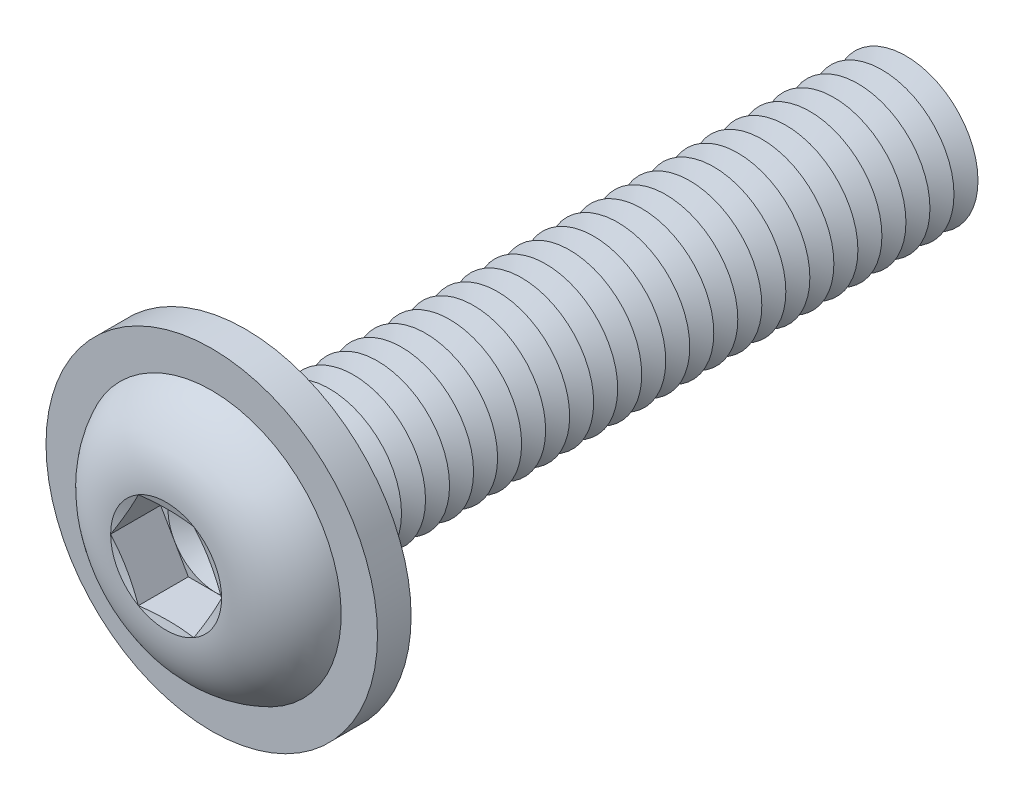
ISO-10303-21;
HEADER;
FILE_DESCRIPTION(('STEP AP214'),'2;1');
FILE_NAME('part.step','',(''),(''),'','','');
FILE_SCHEMA(('AUTOMOTIVE_DESIGN { 1 0 10303 214 1 1 1 1 }'));
ENDSEC;
DATA;
#1=APPLICATION_CONTEXT('core data for automotive mechanical design processes');
#2=APPLICATION_PROTOCOL_DEFINITION('international standard','automotive_design',2000,#1);
#3=PRODUCT_CONTEXT('',#1,'mechanical');
#4=PRODUCT('Part','Part','',(#3));
#5=PRODUCT_RELATED_PRODUCT_CATEGORY('part','',(#4));
#6=PRODUCT_DEFINITION_FORMATION('','',#4);
#7=PRODUCT_DEFINITION_CONTEXT('part definition',#1,'design');
#8=PRODUCT_DEFINITION('design','',#6,#7);
#9=PRODUCT_DEFINITION_SHAPE('','',#8);
#10=(LENGTH_UNIT() NAMED_UNIT(*) SI_UNIT(.MILLI.,.METRE.));
#11=(NAMED_UNIT(*) PLANE_ANGLE_UNIT() SI_UNIT($,.RADIAN.));
#12=(NAMED_UNIT(*) SI_UNIT($,.STERADIAN.) SOLID_ANGLE_UNIT());
#13=UNCERTAINTY_MEASURE_WITH_UNIT(LENGTH_MEASURE(1.E-05),#10,'distance_accuracy_value','');
#14=(GEOMETRIC_REPRESENTATION_CONTEXT(3) GLOBAL_UNCERTAINTY_ASSIGNED_CONTEXT((#13)) GLOBAL_UNIT_ASSIGNED_CONTEXT((#10,
#11,#12)) REPRESENTATION_CONTEXT('',''));
#15=CARTESIAN_POINT('',(0.,0.,0.));
#16=DIRECTION('',(0.,0.,1.));
#17=DIRECTION('',(1.,0.,0.));
#18=AXIS2_PLACEMENT_3D('',#15,#16,#17);
#19=CARTESIAN_POINT('',(0.,0.,-12.25));
#20=DIRECTION('',(0.,0.,1.));
#21=DIRECTION('',(1.,0.,0.));
#22=AXIS2_PLACEMENT_3D('',#19,#20,#21);
#23=CONICAL_SURFACE('',#22,1.5,1.0471975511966);
#24=CARTESIAN_POINT('',(0.,0.,-12.5));
#25=DIRECTION('',(0.,0.,1.));
#26=DIRECTION('',(1.,0.,0.));
#27=AXIS2_PLACEMENT_3D('',#24,#25,#26);
#28=CIRCLE('',#27,1.06698729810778);
#29=CARTESIAN_POINT('',(1.06698729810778,0.,-12.5));
#30=VERTEX_POINT('',#29);
#31=EDGE_CURVE('E435',#30,#30,#28,.T.);
#32=ORIENTED_EDGE('',*,*,#31,.T.);
#33=EDGE_LOOP('',(#32));
#34=FACE_BOUND('',#33,.T.);
#35=CARTESIAN_POINT('',(0.,0.,-12.25));
#36=DIRECTION('',(0.,0.,1.));
#37=DIRECTION('',(1.,0.,0.));
#38=AXIS2_PLACEMENT_3D('',#35,#36,#37);
#39=CIRCLE('',#38,1.5);
#40=CARTESIAN_POINT('',(1.5,0.,-12.25));
#41=VERTEX_POINT('',#40);
#42=EDGE_CURVE('E431',#41,#41,#39,.T.);
#43=ORIENTED_EDGE('',*,*,#42,.F.);
#44=EDGE_LOOP('',(#43));
#45=FACE_BOUND('',#44,.T.);
#46=ADVANCED_FACE('F39',(#34,#45),#23,.T.);
#47=CARTESIAN_POINT('',(0.,0.,-12.5));
#48=DIRECTION('',(0.,0.,-1.));
#49=DIRECTION('',(-1.,0.,0.));
#50=AXIS2_PLACEMENT_3D('',#47,#48,#49);
#51=CONICAL_SURFACE('',#50,1.06698729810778,1.0471975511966);
#52=CARTESIAN_POINT('',(0.,0.,-12.75));
#53=DIRECTION('',(0.,0.,1.));
#54=DIRECTION('',(1.,0.,0.));
#55=AXIS2_PLACEMENT_3D('',#52,#53,#54);
#56=CIRCLE('',#55,1.5);
#57=CARTESIAN_POINT('',(1.5,0.,-12.75));
#58=VERTEX_POINT('',#57);
#59=EDGE_CURVE('E439',#58,#58,#56,.T.);
#60=ORIENTED_EDGE('',*,*,#59,.T.);
#61=EDGE_LOOP('',(#60));
#62=FACE_BOUND('',#61,.T.);
#63=ORIENTED_EDGE('',*,*,#31,.F.);
#64=EDGE_LOOP('',(#63));
#65=FACE_BOUND('',#64,.T.);
#66=ADVANCED_FACE('F580',(#62,#65),#51,.T.);
#67=CARTESIAN_POINT('',(0.,1.50000000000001,-14.));
#68=DIRECTION('',(0.,0.,-1.));
#69=DIRECTION('',(-1.,0.,0.));
#70=AXIS2_PLACEMENT_3D('',#67,#68,#69);
#71=PLANE('',#70);
#72=CARTESIAN_POINT('',(0.,0.,-14.));
#73=DIRECTION('',(0.,0.,1.));
#74=DIRECTION('',(1.,0.,0.));
#75=AXIS2_PLACEMENT_3D('',#72,#73,#74);
#76=CIRCLE('',#75,1.06698729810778);
#77=CARTESIAN_POINT('',(1.06698729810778,0.,-14.));
#78=VERTEX_POINT('',#77);
#79=EDGE_CURVE('E458',#78,#78,#76,.T.);
#80=ORIENTED_EDGE('',*,*,#79,.F.);
#81=EDGE_LOOP('',(#80));
#82=FACE_BOUND('',#81,.T.);
#83=ADVANCED_FACE('F586',(#82),#71,.T.);
#84=CARTESIAN_POINT('',(0.,0.,-13.75));
#85=DIRECTION('',(0.,0.,1.));
#86=DIRECTION('',(1.,0.,0.));
#87=AXIS2_PLACEMENT_3D('',#84,#85,#86);
#88=CONICAL_SURFACE('',#87,1.5,1.0471975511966);
#89=ORIENTED_EDGE('',*,*,#79,.T.);
#90=EDGE_LOOP('',(#89));
#91=FACE_BOUND('',#90,.T.);
#92=CARTESIAN_POINT('',(0.,0.,-13.75));
#93=DIRECTION('',(0.,0.,1.));
#94=DIRECTION('',(1.,0.,0.));
#95=AXIS2_PLACEMENT_3D('',#92,#93,#94);
#96=CIRCLE('',#95,1.5);
#97=CARTESIAN_POINT('',(1.5,0.,-13.75));
#98=VERTEX_POINT('',#97);
#99=EDGE_CURVE('E454',#98,#98,#96,.T.);
#100=ORIENTED_EDGE('',*,*,#99,.F.);
#101=EDGE_LOOP('',(#100));
#102=FACE_BOUND('',#101,.T.);
#103=ADVANCED_FACE('F605',(#91,#102),#88,.T.);
#104=CARTESIAN_POINT('',(0.,0.,-13.5));
#105=DIRECTION('',(0.,0.,-1.));
#106=DIRECTION('',(-1.,0.,0.));
#107=AXIS2_PLACEMENT_3D('',#104,#105,#106);
#108=CONICAL_SURFACE('',#107,1.06698729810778,1.0471975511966);
#109=ORIENTED_EDGE('',*,*,#99,.T.);
#110=EDGE_LOOP('',(#109));
#111=FACE_BOUND('',#110,.T.);
#112=CARTESIAN_POINT('',(0.,0.,-13.5));
#113=DIRECTION('',(0.,0.,1.));
#114=DIRECTION('',(1.,0.,0.));
#115=AXIS2_PLACEMENT_3D('',#112,#113,#114);
#116=CIRCLE('',#115,1.06698729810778);
#117=CARTESIAN_POINT('',(1.06698729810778,0.,-13.5));
#118=VERTEX_POINT('',#117);
#119=EDGE_CURVE('E450',#118,#118,#116,.T.);
#120=ORIENTED_EDGE('',*,*,#119,.F.);
#121=EDGE_LOOP('',(#120));
#122=FACE_BOUND('',#121,.T.);
#123=ADVANCED_FACE('F602',(#111,#122),#108,.T.);
#124=CARTESIAN_POINT('',(0.,0.,-13.25));
#125=DIRECTION('',(0.,0.,1.));
#126=DIRECTION('',(1.,0.,0.));
#127=AXIS2_PLACEMENT_3D('',#124,#125,#126);
#128=CONICAL_SURFACE('',#127,1.5,1.0471975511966);
#129=ORIENTED_EDGE('',*,*,#119,.T.);
#130=EDGE_LOOP('',(#129));
#131=FACE_BOUND('',#130,.T.);
#132=CARTESIAN_POINT('',(0.,0.,-13.25));
#133=DIRECTION('',(0.,0.,1.));
#134=DIRECTION('',(1.,0.,0.));
#135=AXIS2_PLACEMENT_3D('',#132,#133,#134);
#136=CIRCLE('',#135,1.5);
#137=CARTESIAN_POINT('',(1.5,0.,-13.25));
#138=VERTEX_POINT('',#137);
#139=EDGE_CURVE('E446',#138,#138,#136,.T.);
#140=ORIENTED_EDGE('',*,*,#139,.F.);
#141=EDGE_LOOP('',(#140));
#142=FACE_BOUND('',#141,.T.);
#143=ADVANCED_FACE('F596',(#131,#142),#128,.T.);
#144=CARTESIAN_POINT('',(0.,0.,-13.));
#145=DIRECTION('',(0.,0.,-1.));
#146=DIRECTION('',(-1.,0.,0.));
#147=AXIS2_PLACEMENT_3D('',#144,#145,#146);
#148=CONICAL_SURFACE('',#147,1.06698729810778,1.0471975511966);
#149=ORIENTED_EDGE('',*,*,#139,.T.);
#150=EDGE_LOOP('',(#149));
#151=FACE_BOUND('',#150,.T.);
#152=CARTESIAN_POINT('',(0.,0.,-13.));
#153=DIRECTION('',(0.,0.,1.));
#154=DIRECTION('',(1.,0.,0.));
#155=AXIS2_PLACEMENT_3D('',#152,#153,#154);
#156=CIRCLE('',#155,1.06698729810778);
#157=CARTESIAN_POINT('',(1.06698729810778,0.,-13.));
#158=VERTEX_POINT('',#157);
#159=EDGE_CURVE('E443',#158,#158,#156,.T.);
#160=ORIENTED_EDGE('',*,*,#159,.F.);
#161=EDGE_LOOP('',(#160));
#162=FACE_BOUND('',#161,.T.);
#163=ADVANCED_FACE('F592',(#151,#162),#148,.T.);
#164=CARTESIAN_POINT('',(0.,0.,-12.75));
#165=DIRECTION('',(0.,0.,1.));
#166=DIRECTION('',(1.,0.,0.));
#167=AXIS2_PLACEMENT_3D('',#164,#165,#166);
#168=CONICAL_SURFACE('',#167,1.5,1.0471975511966);
#169=ORIENTED_EDGE('',*,*,#159,.T.);
#170=EDGE_LOOP('',(#169));
#171=FACE_BOUND('',#170,.T.);
#172=ORIENTED_EDGE('',*,*,#59,.F.);
#173=EDGE_LOOP('',(#172));
#174=FACE_BOUND('',#173,.T.);
#175=ADVANCED_FACE('F595',(#171,#174),#168,.T.);
#176=CARTESIAN_POINT('',(0.,0.,-11.75));
#177=DIRECTION('',(0.,0.,1.));
#178=DIRECTION('',(1.,0.,0.));
#179=AXIS2_PLACEMENT_3D('',#176,#177,#178);
#180=CONICAL_SURFACE('',#179,1.5,1.0471975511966);
#181=CARTESIAN_POINT('',(0.,0.,-12.));
#182=DIRECTION('',(0.,0.,1.));
#183=DIRECTION('',(1.,0.,0.));
#184=AXIS2_PLACEMENT_3D('',#181,#182,#183);
#185=CIRCLE('',#184,1.06698729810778);
#186=CARTESIAN_POINT('',(1.06698729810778,0.,-12.));
#187=VERTEX_POINT('',#186);
#188=EDGE_CURVE('E427',#187,#187,#185,.T.);
#189=ORIENTED_EDGE('',*,*,#188,.T.);
#190=EDGE_LOOP('',(#189));
#191=FACE_BOUND('',#190,.T.);
#192=CARTESIAN_POINT('',(0.,0.,-11.75));
#193=DIRECTION('',(0.,0.,1.));
#194=DIRECTION('',(1.,0.,0.));
#195=AXIS2_PLACEMENT_3D('',#192,#193,#194);
#196=CIRCLE('',#195,1.5);
#197=CARTESIAN_POINT('',(1.5,0.,-11.75));
#198=VERTEX_POINT('',#197);
#199=EDGE_CURVE('E423',#198,#198,#196,.T.);
#200=ORIENTED_EDGE('',*,*,#199,.F.);
#201=EDGE_LOOP('',(#200));
#202=FACE_BOUND('',#201,.T.);
#203=ADVANCED_FACE('F600',(#191,#202),#180,.T.);
#204=CARTESIAN_POINT('',(0.,0.,-12.));
#205=DIRECTION('',(0.,0.,-1.));
#206=DIRECTION('',(-1.,0.,0.));
#207=AXIS2_PLACEMENT_3D('',#204,#205,#206);
#208=CONICAL_SURFACE('',#207,1.06698729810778,1.0471975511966);
#209=ORIENTED_EDGE('',*,*,#42,.T.);
#210=EDGE_LOOP('',(#209));
#211=FACE_BOUND('',#210,.T.);
#212=ORIENTED_EDGE('',*,*,#188,.F.);
#213=EDGE_LOOP('',(#212));
#214=FACE_BOUND('',#213,.T.);
#215=ADVANCED_FACE('F651',(#211,#214),#208,.T.);
#216=CARTESIAN_POINT('',(0.,0.,-11.25));
#217=DIRECTION('',(0.,0.,1.));
#218=DIRECTION('',(1.,0.,0.));
#219=AXIS2_PLACEMENT_3D('',#216,#217,#218);
#220=CONICAL_SURFACE('',#219,1.5,1.0471975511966);
#221=CARTESIAN_POINT('',(0.,0.,-11.5));
#222=DIRECTION('',(0.,0.,1.));
#223=DIRECTION('',(1.,0.,0.));
#224=AXIS2_PLACEMENT_3D('',#221,#222,#223);
#225=CIRCLE('',#224,1.06698729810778);
#226=CARTESIAN_POINT('',(1.06698729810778,0.,-11.5));
#227=VERTEX_POINT('',#226);
#228=EDGE_CURVE('E419',#227,#227,#225,.T.);
#229=ORIENTED_EDGE('',*,*,#228,.T.);
#230=EDGE_LOOP('',(#229));
#231=FACE_BOUND('',#230,.T.);
#232=CARTESIAN_POINT('',(0.,0.,-11.25));
#233=DIRECTION('',(0.,0.,1.));
#234=DIRECTION('',(1.,0.,0.));
#235=AXIS2_PLACEMENT_3D('',#232,#233,#234);
#236=CIRCLE('',#235,1.5);
#237=CARTESIAN_POINT('',(1.5,0.,-11.25));
#238=VERTEX_POINT('',#237);
#239=EDGE_CURVE('E415',#238,#238,#236,.T.);
#240=ORIENTED_EDGE('',*,*,#239,.F.);
#241=EDGE_LOOP('',(#240));
#242=FACE_BOUND('',#241,.T.);
#243=ADVANCED_FACE('F657',(#231,#242),#220,.T.);
#244=CARTESIAN_POINT('',(0.,0.,-11.5));
#245=DIRECTION('',(0.,0.,-1.));
#246=DIRECTION('',(-1.,0.,0.));
#247=AXIS2_PLACEMENT_3D('',#244,#245,#246);
#248=CONICAL_SURFACE('',#247,1.06698729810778,1.0471975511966);
#249=ORIENTED_EDGE('',*,*,#199,.T.);
#250=EDGE_LOOP('',(#249));
#251=FACE_BOUND('',#250,.T.);
#252=ORIENTED_EDGE('',*,*,#228,.F.);
#253=EDGE_LOOP('',(#252));
#254=FACE_BOUND('',#253,.T.);
#255=ADVANCED_FACE('F664',(#251,#254),#248,.T.);
#256=CARTESIAN_POINT('',(0.,0.,-10.75));
#257=DIRECTION('',(0.,0.,1.));
#258=DIRECTION('',(1.,0.,0.));
#259=AXIS2_PLACEMENT_3D('',#256,#257,#258);
#260=CONICAL_SURFACE('',#259,1.5,1.0471975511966);
#261=CARTESIAN_POINT('',(0.,0.,-11.));
#262=DIRECTION('',(0.,0.,1.));
#263=DIRECTION('',(1.,0.,0.));
#264=AXIS2_PLACEMENT_3D('',#261,#262,#263);
#265=CIRCLE('',#264,1.06698729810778);
#266=CARTESIAN_POINT('',(1.06698729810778,0.,-11.));
#267=VERTEX_POINT('',#266);
#268=EDGE_CURVE('E411',#267,#267,#265,.T.);
#269=ORIENTED_EDGE('',*,*,#268,.T.);
#270=EDGE_LOOP('',(#269));
#271=FACE_BOUND('',#270,.T.);
#272=CARTESIAN_POINT('',(0.,0.,-10.75));
#273=DIRECTION('',(0.,0.,1.));
#274=DIRECTION('',(1.,0.,0.));
#275=AXIS2_PLACEMENT_3D('',#272,#273,#274);
#276=CIRCLE('',#275,1.5);
#277=CARTESIAN_POINT('',(1.5,0.,-10.75));
#278=VERTEX_POINT('',#277);
#279=EDGE_CURVE('E407',#278,#278,#276,.T.);
#280=ORIENTED_EDGE('',*,*,#279,.F.);
#281=EDGE_LOOP('',(#280));
#282=FACE_BOUND('',#281,.T.);
#283=ADVANCED_FACE('F671',(#271,#282),#260,.T.);
#284=CARTESIAN_POINT('',(0.,0.,-11.));
#285=DIRECTION('',(0.,0.,-1.));
#286=DIRECTION('',(-1.,0.,0.));
#287=AXIS2_PLACEMENT_3D('',#284,#285,#286);
#288=CONICAL_SURFACE('',#287,1.06698729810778,1.0471975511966);
#289=ORIENTED_EDGE('',*,*,#239,.T.);
#290=EDGE_LOOP('',(#289));
#291=FACE_BOUND('',#290,.T.);
#292=ORIENTED_EDGE('',*,*,#268,.F.);
#293=EDGE_LOOP('',(#292));
#294=FACE_BOUND('',#293,.T.);
#295=ADVANCED_FACE('F678',(#291,#294),#288,.T.);
#296=CARTESIAN_POINT('',(0.,0.,-10.25));
#297=DIRECTION('',(0.,0.,1.));
#298=DIRECTION('',(1.,0.,0.));
#299=AXIS2_PLACEMENT_3D('',#296,#297,#298);
#300=CONICAL_SURFACE('',#299,1.5,1.0471975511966);
#301=CARTESIAN_POINT('',(0.,0.,-10.5));
#302=DIRECTION('',(0.,0.,1.));
#303=DIRECTION('',(1.,0.,0.));
#304=AXIS2_PLACEMENT_3D('',#301,#302,#303);
#305=CIRCLE('',#304,1.06698729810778);
#306=CARTESIAN_POINT('',(1.06698729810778,0.,-10.5));
#307=VERTEX_POINT('',#306);
#308=EDGE_CURVE('E403',#307,#307,#305,.T.);
#309=ORIENTED_EDGE('',*,*,#308,.T.);
#310=EDGE_LOOP('',(#309));
#311=FACE_BOUND('',#310,.T.);
#312=CARTESIAN_POINT('',(0.,0.,-10.25));
#313=DIRECTION('',(0.,0.,1.));
#314=DIRECTION('',(1.,0.,0.));
#315=AXIS2_PLACEMENT_3D('',#312,#313,#314);
#316=CIRCLE('',#315,1.5);
#317=CARTESIAN_POINT('',(1.5,0.,-10.25));
#318=VERTEX_POINT('',#317);
#319=EDGE_CURVE('E399',#318,#318,#316,.T.);
#320=ORIENTED_EDGE('',*,*,#319,.F.);
#321=EDGE_LOOP('',(#320));
#322=FACE_BOUND('',#321,.T.);
#323=ADVANCED_FACE('F685',(#311,#322),#300,.T.);
#324=CARTESIAN_POINT('',(0.,0.,-10.5));
#325=DIRECTION('',(0.,0.,-1.));
#326=DIRECTION('',(-1.,0.,0.));
#327=AXIS2_PLACEMENT_3D('',#324,#325,#326);
#328=CONICAL_SURFACE('',#327,1.06698729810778,1.0471975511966);
#329=ORIENTED_EDGE('',*,*,#279,.T.);
#330=EDGE_LOOP('',(#329));
#331=FACE_BOUND('',#330,.T.);
#332=ORIENTED_EDGE('',*,*,#308,.F.);
#333=EDGE_LOOP('',(#332));
#334=FACE_BOUND('',#333,.T.);
#335=ADVANCED_FACE('F692',(#331,#334),#328,.T.);
#336=CARTESIAN_POINT('',(0.,0.,-9.75));
#337=DIRECTION('',(0.,0.,1.));
#338=DIRECTION('',(1.,0.,0.));
#339=AXIS2_PLACEMENT_3D('',#336,#337,#338);
#340=CONICAL_SURFACE('',#339,1.5,1.0471975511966);
#341=CARTESIAN_POINT('',(0.,0.,-10.));
#342=DIRECTION('',(0.,0.,1.));
#343=DIRECTION('',(1.,0.,0.));
#344=AXIS2_PLACEMENT_3D('',#341,#342,#343);
#345=CIRCLE('',#344,1.06698729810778);
#346=CARTESIAN_POINT('',(1.06698729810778,0.,-10.));
#347=VERTEX_POINT('',#346);
#348=EDGE_CURVE('E395',#347,#347,#345,.T.);
#349=ORIENTED_EDGE('',*,*,#348,.T.);
#350=EDGE_LOOP('',(#349));
#351=FACE_BOUND('',#350,.T.);
#352=CARTESIAN_POINT('',(0.,0.,-9.75));
#353=DIRECTION('',(0.,0.,1.));
#354=DIRECTION('',(1.,0.,0.));
#355=AXIS2_PLACEMENT_3D('',#352,#353,#354);
#356=CIRCLE('',#355,1.5);
#357=CARTESIAN_POINT('',(1.5,0.,-9.75));
#358=VERTEX_POINT('',#357);
#359=EDGE_CURVE('E391',#358,#358,#356,.T.);
#360=ORIENTED_EDGE('',*,*,#359,.F.);
#361=EDGE_LOOP('',(#360));
#362=FACE_BOUND('',#361,.T.);
#363=ADVANCED_FACE('F699',(#351,#362),#340,.T.);
#364=CARTESIAN_POINT('',(0.,0.,-10.));
#365=DIRECTION('',(0.,0.,-1.));
#366=DIRECTION('',(-1.,0.,0.));
#367=AXIS2_PLACEMENT_3D('',#364,#365,#366);
#368=CONICAL_SURFACE('',#367,1.06698729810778,1.0471975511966);
#369=ORIENTED_EDGE('',*,*,#319,.T.);
#370=EDGE_LOOP('',(#369));
#371=FACE_BOUND('',#370,.T.);
#372=ORIENTED_EDGE('',*,*,#348,.F.);
#373=EDGE_LOOP('',(#372));
#374=FACE_BOUND('',#373,.T.);
#375=ADVANCED_FACE('F706',(#371,#374),#368,.T.);
#376=CARTESIAN_POINT('',(0.,0.,-9.25));
#377=DIRECTION('',(0.,0.,1.));
#378=DIRECTION('',(1.,0.,0.));
#379=AXIS2_PLACEMENT_3D('',#376,#377,#378);
#380=CONICAL_SURFACE('',#379,1.5,1.0471975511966);
#381=CARTESIAN_POINT('',(0.,0.,-9.5));
#382=DIRECTION('',(0.,0.,1.));
#383=DIRECTION('',(1.,0.,0.));
#384=AXIS2_PLACEMENT_3D('',#381,#382,#383);
#385=CIRCLE('',#384,1.06698729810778);
#386=CARTESIAN_POINT('',(1.06698729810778,0.,-9.5));
#387=VERTEX_POINT('',#386);
#388=EDGE_CURVE('E387',#387,#387,#385,.T.);
#389=ORIENTED_EDGE('',*,*,#388,.T.);
#390=EDGE_LOOP('',(#389));
#391=FACE_BOUND('',#390,.T.);
#392=CARTESIAN_POINT('',(0.,0.,-9.25));
#393=DIRECTION('',(0.,0.,1.));
#394=DIRECTION('',(1.,0.,0.));
#395=AXIS2_PLACEMENT_3D('',#392,#393,#394);
#396=CIRCLE('',#395,1.5);
#397=CARTESIAN_POINT('',(1.5,0.,-9.25));
#398=VERTEX_POINT('',#397);
#399=EDGE_CURVE('E383',#398,#398,#396,.T.);
#400=ORIENTED_EDGE('',*,*,#399,.F.);
#401=EDGE_LOOP('',(#400));
#402=FACE_BOUND('',#401,.T.);
#403=ADVANCED_FACE('F713',(#391,#402),#380,.T.);
#404=CARTESIAN_POINT('',(0.,0.,-9.5));
#405=DIRECTION('',(0.,0.,-1.));
#406=DIRECTION('',(-1.,0.,0.));
#407=AXIS2_PLACEMENT_3D('',#404,#405,#406);
#408=CONICAL_SURFACE('',#407,1.06698729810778,1.0471975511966);
#409=ORIENTED_EDGE('',*,*,#359,.T.);
#410=EDGE_LOOP('',(#409));
#411=FACE_BOUND('',#410,.T.);
#412=ORIENTED_EDGE('',*,*,#388,.F.);
#413=EDGE_LOOP('',(#412));
#414=FACE_BOUND('',#413,.T.);
#415=ADVANCED_FACE('F720',(#411,#414),#408,.T.);
#416=CARTESIAN_POINT('',(0.,0.,-8.75));
#417=DIRECTION('',(0.,0.,1.));
#418=DIRECTION('',(1.,0.,0.));
#419=AXIS2_PLACEMENT_3D('',#416,#417,#418);
#420=CONICAL_SURFACE('',#419,1.5,1.0471975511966);
#421=CARTESIAN_POINT('',(0.,0.,-9.));
#422=DIRECTION('',(0.,0.,1.));
#423=DIRECTION('',(1.,0.,0.));
#424=AXIS2_PLACEMENT_3D('',#421,#422,#423);
#425=CIRCLE('',#424,1.06698729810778);
#426=CARTESIAN_POINT('',(1.06698729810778,0.,-9.));
#427=VERTEX_POINT('',#426);
#428=EDGE_CURVE('E379',#427,#427,#425,.T.);
#429=ORIENTED_EDGE('',*,*,#428,.T.);
#430=EDGE_LOOP('',(#429));
#431=FACE_BOUND('',#430,.T.);
#432=CARTESIAN_POINT('',(0.,0.,-8.75));
#433=DIRECTION('',(0.,0.,1.));
#434=DIRECTION('',(1.,0.,0.));
#435=AXIS2_PLACEMENT_3D('',#432,#433,#434);
#436=CIRCLE('',#435,1.5);
#437=CARTESIAN_POINT('',(1.5,0.,-8.75));
#438=VERTEX_POINT('',#437);
#439=EDGE_CURVE('E375',#438,#438,#436,.T.);
#440=ORIENTED_EDGE('',*,*,#439,.F.);
#441=EDGE_LOOP('',(#440));
#442=FACE_BOUND('',#441,.T.);
#443=ADVANCED_FACE('F727',(#431,#442),#420,.T.);
#444=CARTESIAN_POINT('',(0.,0.,-9.));
#445=DIRECTION('',(0.,0.,-1.));
#446=DIRECTION('',(-1.,0.,0.));
#447=AXIS2_PLACEMENT_3D('',#444,#445,#446);
#448=CONICAL_SURFACE('',#447,1.06698729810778,1.0471975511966);
#449=ORIENTED_EDGE('',*,*,#399,.T.);
#450=EDGE_LOOP('',(#449));
#451=FACE_BOUND('',#450,.T.);
#452=ORIENTED_EDGE('',*,*,#428,.F.);
#453=EDGE_LOOP('',(#452));
#454=FACE_BOUND('',#453,.T.);
#455=ADVANCED_FACE('F734',(#451,#454),#448,.T.);
#456=CARTESIAN_POINT('',(0.,0.,-8.25));
#457=DIRECTION('',(0.,0.,1.));
#458=DIRECTION('',(1.,0.,0.));
#459=AXIS2_PLACEMENT_3D('',#456,#457,#458);
#460=CONICAL_SURFACE('',#459,1.5,1.0471975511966);
#461=CARTESIAN_POINT('',(0.,0.,-8.5));
#462=DIRECTION('',(0.,0.,1.));
#463=DIRECTION('',(1.,0.,0.));
#464=AXIS2_PLACEMENT_3D('',#461,#462,#463);
#465=CIRCLE('',#464,1.06698729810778);
#466=CARTESIAN_POINT('',(1.06698729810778,0.,-8.5));
#467=VERTEX_POINT('',#466);
#468=EDGE_CURVE('E371',#467,#467,#465,.T.);
#469=ORIENTED_EDGE('',*,*,#468,.T.);
#470=EDGE_LOOP('',(#469));
#471=FACE_BOUND('',#470,.T.);
#472=CARTESIAN_POINT('',(0.,0.,-8.25));
#473=DIRECTION('',(0.,0.,1.));
#474=DIRECTION('',(1.,0.,0.));
#475=AXIS2_PLACEMENT_3D('',#472,#473,#474);
#476=CIRCLE('',#475,1.5);
#477=CARTESIAN_POINT('',(1.5,0.,-8.25));
#478=VERTEX_POINT('',#477);
#479=EDGE_CURVE('E367',#478,#478,#476,.T.);
#480=ORIENTED_EDGE('',*,*,#479,.F.);
#481=EDGE_LOOP('',(#480));
#482=FACE_BOUND('',#481,.T.);
#483=ADVANCED_FACE('F741',(#471,#482),#460,.T.);
#484=CARTESIAN_POINT('',(0.,0.,-8.5));
#485=DIRECTION('',(0.,0.,-1.));
#486=DIRECTION('',(-1.,0.,0.));
#487=AXIS2_PLACEMENT_3D('',#484,#485,#486);
#488=CONICAL_SURFACE('',#487,1.06698729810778,1.0471975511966);
#489=ORIENTED_EDGE('',*,*,#439,.T.);
#490=EDGE_LOOP('',(#489));
#491=FACE_BOUND('',#490,.T.);
#492=ORIENTED_EDGE('',*,*,#468,.F.);
#493=EDGE_LOOP('',(#492));
#494=FACE_BOUND('',#493,.T.);
#495=ADVANCED_FACE('F748',(#491,#494),#488,.T.);
#496=CARTESIAN_POINT('',(0.,0.,-7.75));
#497=DIRECTION('',(0.,0.,1.));
#498=DIRECTION('',(1.,0.,0.));
#499=AXIS2_PLACEMENT_3D('',#496,#497,#498);
#500=CONICAL_SURFACE('',#499,1.5,1.0471975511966);
#501=CARTESIAN_POINT('',(0.,0.,-8.));
#502=DIRECTION('',(0.,0.,1.));
#503=DIRECTION('',(1.,0.,0.));
#504=AXIS2_PLACEMENT_3D('',#501,#502,#503);
#505=CIRCLE('',#504,1.06698729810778);
#506=CARTESIAN_POINT('',(1.06698729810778,0.,-8.));
#507=VERTEX_POINT('',#506);
#508=EDGE_CURVE('E363',#507,#507,#505,.T.);
#509=ORIENTED_EDGE('',*,*,#508,.T.);
#510=EDGE_LOOP('',(#509));
#511=FACE_BOUND('',#510,.T.);
#512=CARTESIAN_POINT('',(0.,0.,-7.75));
#513=DIRECTION('',(0.,0.,1.));
#514=DIRECTION('',(1.,0.,0.));
#515=AXIS2_PLACEMENT_3D('',#512,#513,#514);
#516=CIRCLE('',#515,1.5);
#517=CARTESIAN_POINT('',(1.5,0.,-7.75));
#518=VERTEX_POINT('',#517);
#519=EDGE_CURVE('E359',#518,#518,#516,.T.);
#520=ORIENTED_EDGE('',*,*,#519,.F.);
#521=EDGE_LOOP('',(#520));
#522=FACE_BOUND('',#521,.T.);
#523=ADVANCED_FACE('F755',(#511,#522),#500,.T.);
#524=CARTESIAN_POINT('',(0.,0.,-8.));
#525=DIRECTION('',(0.,0.,-1.));
#526=DIRECTION('',(-1.,0.,0.));
#527=AXIS2_PLACEMENT_3D('',#524,#525,#526);
#528=CONICAL_SURFACE('',#527,1.06698729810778,1.0471975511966);
#529=ORIENTED_EDGE('',*,*,#479,.T.);
#530=EDGE_LOOP('',(#529));
#531=FACE_BOUND('',#530,.T.);
#532=ORIENTED_EDGE('',*,*,#508,.F.);
#533=EDGE_LOOP('',(#532));
#534=FACE_BOUND('',#533,.T.);
#535=ADVANCED_FACE('F762',(#531,#534),#528,.T.);
#536=CARTESIAN_POINT('',(0.,0.,-7.25));
#537=DIRECTION('',(0.,0.,1.));
#538=DIRECTION('',(1.,0.,0.));
#539=AXIS2_PLACEMENT_3D('',#536,#537,#538);
#540=CONICAL_SURFACE('',#539,1.5,1.0471975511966);
#541=CARTESIAN_POINT('',(0.,0.,-7.5));
#542=DIRECTION('',(0.,0.,1.));
#543=DIRECTION('',(1.,0.,0.));
#544=AXIS2_PLACEMENT_3D('',#541,#542,#543);
#545=CIRCLE('',#544,1.06698729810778);
#546=CARTESIAN_POINT('',(1.06698729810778,0.,-7.5));
#547=VERTEX_POINT('',#546);
#548=EDGE_CURVE('E355',#547,#547,#545,.T.);
#549=ORIENTED_EDGE('',*,*,#548,.T.);
#550=EDGE_LOOP('',(#549));
#551=FACE_BOUND('',#550,.T.);
#552=CARTESIAN_POINT('',(0.,0.,-7.25));
#553=DIRECTION('',(0.,0.,1.));
#554=DIRECTION('',(1.,0.,0.));
#555=AXIS2_PLACEMENT_3D('',#552,#553,#554);
#556=CIRCLE('',#555,1.5);
#557=CARTESIAN_POINT('',(1.5,0.,-7.25));
#558=VERTEX_POINT('',#557);
#559=EDGE_CURVE('E351',#558,#558,#556,.T.);
#560=ORIENTED_EDGE('',*,*,#559,.F.);
#561=EDGE_LOOP('',(#560));
#562=FACE_BOUND('',#561,.T.);
#563=ADVANCED_FACE('F769',(#551,#562),#540,.T.);
#564=CARTESIAN_POINT('',(0.,0.,-7.5));
#565=DIRECTION('',(0.,0.,-1.));
#566=DIRECTION('',(-1.,0.,0.));
#567=AXIS2_PLACEMENT_3D('',#564,#565,#566);
#568=CONICAL_SURFACE('',#567,1.06698729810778,1.0471975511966);
#569=ORIENTED_EDGE('',*,*,#519,.T.);
#570=EDGE_LOOP('',(#569));
#571=FACE_BOUND('',#570,.T.);
#572=ORIENTED_EDGE('',*,*,#548,.F.);
#573=EDGE_LOOP('',(#572));
#574=FACE_BOUND('',#573,.T.);
#575=ADVANCED_FACE('F776',(#571,#574),#568,.T.);
#576=CARTESIAN_POINT('',(0.,0.,-6.75));
#577=DIRECTION('',(0.,0.,1.));
#578=DIRECTION('',(1.,0.,0.));
#579=AXIS2_PLACEMENT_3D('',#576,#577,#578);
#580=CONICAL_SURFACE('',#579,1.5,1.0471975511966);
#581=CARTESIAN_POINT('',(0.,0.,-7.));
#582=DIRECTION('',(0.,0.,1.));
#583=DIRECTION('',(1.,0.,0.));
#584=AXIS2_PLACEMENT_3D('',#581,#582,#583);
#585=CIRCLE('',#584,1.06698729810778);
#586=CARTESIAN_POINT('',(1.06698729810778,0.,-7.));
#587=VERTEX_POINT('',#586);
#588=EDGE_CURVE('E347',#587,#587,#585,.T.);
#589=ORIENTED_EDGE('',*,*,#588,.T.);
#590=EDGE_LOOP('',(#589));
#591=FACE_BOUND('',#590,.T.);
#592=CARTESIAN_POINT('',(0.,0.,-6.75));
#593=DIRECTION('',(0.,0.,1.));
#594=DIRECTION('',(1.,0.,0.));
#595=AXIS2_PLACEMENT_3D('',#592,#593,#594);
#596=CIRCLE('',#595,1.5);
#597=CARTESIAN_POINT('',(1.5,0.,-6.75));
#598=VERTEX_POINT('',#597);
#599=EDGE_CURVE('E343',#598,#598,#596,.T.);
#600=ORIENTED_EDGE('',*,*,#599,.F.);
#601=EDGE_LOOP('',(#600));
#602=FACE_BOUND('',#601,.T.);
#603=ADVANCED_FACE('F783',(#591,#602),#580,.T.);
#604=CARTESIAN_POINT('',(0.,0.,-7.));
#605=DIRECTION('',(0.,0.,-1.));
#606=DIRECTION('',(-1.,0.,0.));
#607=AXIS2_PLACEMENT_3D('',#604,#605,#606);
#608=CONICAL_SURFACE('',#607,1.06698729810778,1.0471975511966);
#609=ORIENTED_EDGE('',*,*,#559,.T.);
#610=EDGE_LOOP('',(#609));
#611=FACE_BOUND('',#610,.T.);
#612=ORIENTED_EDGE('',*,*,#588,.F.);
#613=EDGE_LOOP('',(#612));
#614=FACE_BOUND('',#613,.T.);
#615=ADVANCED_FACE('F790',(#611,#614),#608,.T.);
#616=CARTESIAN_POINT('',(0.,0.,-6.25));
#617=DIRECTION('',(0.,0.,1.));
#618=DIRECTION('',(1.,0.,0.));
#619=AXIS2_PLACEMENT_3D('',#616,#617,#618);
#620=CONICAL_SURFACE('',#619,1.5,1.0471975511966);
#621=CARTESIAN_POINT('',(0.,0.,-6.5));
#622=DIRECTION('',(0.,0.,1.));
#623=DIRECTION('',(1.,0.,0.));
#624=AXIS2_PLACEMENT_3D('',#621,#622,#623);
#625=CIRCLE('',#624,1.06698729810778);
#626=CARTESIAN_POINT('',(1.06698729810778,0.,-6.5));
#627=VERTEX_POINT('',#626);
#628=EDGE_CURVE('E339',#627,#627,#625,.T.);
#629=ORIENTED_EDGE('',*,*,#628,.T.);
#630=EDGE_LOOP('',(#629));
#631=FACE_BOUND('',#630,.T.);
#632=CARTESIAN_POINT('',(0.,0.,-6.25));
#633=DIRECTION('',(0.,0.,1.));
#634=DIRECTION('',(1.,0.,0.));
#635=AXIS2_PLACEMENT_3D('',#632,#633,#634);
#636=CIRCLE('',#635,1.5);
#637=CARTESIAN_POINT('',(1.5,0.,-6.25));
#638=VERTEX_POINT('',#637);
#639=EDGE_CURVE('E335',#638,#638,#636,.T.);
#640=ORIENTED_EDGE('',*,*,#639,.F.);
#641=EDGE_LOOP('',(#640));
#642=FACE_BOUND('',#641,.T.);
#643=ADVANCED_FACE('F797',(#631,#642),#620,.T.);
#644=CARTESIAN_POINT('',(0.,0.,-6.5));
#645=DIRECTION('',(0.,0.,-1.));
#646=DIRECTION('',(-1.,0.,0.));
#647=AXIS2_PLACEMENT_3D('',#644,#645,#646);
#648=CONICAL_SURFACE('',#647,1.06698729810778,1.0471975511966);
#649=ORIENTED_EDGE('',*,*,#599,.T.);
#650=EDGE_LOOP('',(#649));
#651=FACE_BOUND('',#650,.T.);
#652=ORIENTED_EDGE('',*,*,#628,.F.);
#653=EDGE_LOOP('',(#652));
#654=FACE_BOUND('',#653,.T.);
#655=ADVANCED_FACE('F804',(#651,#654),#648,.T.);
#656=CARTESIAN_POINT('',(0.,0.,-5.75));
#657=DIRECTION('',(0.,0.,1.));
#658=DIRECTION('',(1.,0.,0.));
#659=AXIS2_PLACEMENT_3D('',#656,#657,#658);
#660=CONICAL_SURFACE('',#659,1.5,1.0471975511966);
#661=CARTESIAN_POINT('',(0.,0.,-6.));
#662=DIRECTION('',(0.,0.,1.));
#663=DIRECTION('',(1.,0.,0.));
#664=AXIS2_PLACEMENT_3D('',#661,#662,#663);
#665=CIRCLE('',#664,1.06698729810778);
#666=CARTESIAN_POINT('',(1.06698729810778,0.,-6.));
#667=VERTEX_POINT('',#666);
#668=EDGE_CURVE('E331',#667,#667,#665,.T.);
#669=ORIENTED_EDGE('',*,*,#668,.T.);
#670=EDGE_LOOP('',(#669));
#671=FACE_BOUND('',#670,.T.);
#672=CARTESIAN_POINT('',(0.,0.,-5.75));
#673=DIRECTION('',(0.,0.,1.));
#674=DIRECTION('',(1.,0.,0.));
#675=AXIS2_PLACEMENT_3D('',#672,#673,#674);
#676=CIRCLE('',#675,1.5);
#677=CARTESIAN_POINT('',(1.5,0.,-5.75));
#678=VERTEX_POINT('',#677);
#679=EDGE_CURVE('E327',#678,#678,#676,.T.);
#680=ORIENTED_EDGE('',*,*,#679,.F.);
#681=EDGE_LOOP('',(#680));
#682=FACE_BOUND('',#681,.T.);
#683=ADVANCED_FACE('F811',(#671,#682),#660,.T.);
#684=CARTESIAN_POINT('',(0.,0.,-6.));
#685=DIRECTION('',(0.,0.,-1.));
#686=DIRECTION('',(-1.,0.,0.));
#687=AXIS2_PLACEMENT_3D('',#684,#685,#686);
#688=CONICAL_SURFACE('',#687,1.06698729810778,1.0471975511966);
#689=ORIENTED_EDGE('',*,*,#639,.T.);
#690=EDGE_LOOP('',(#689));
#691=FACE_BOUND('',#690,.T.);
#692=ORIENTED_EDGE('',*,*,#668,.F.);
#693=EDGE_LOOP('',(#692));
#694=FACE_BOUND('',#693,.T.);
#695=ADVANCED_FACE('F818',(#691,#694),#688,.T.);
#696=CARTESIAN_POINT('',(0.,0.,-5.25));
#697=DIRECTION('',(0.,0.,1.));
#698=DIRECTION('',(1.,0.,0.));
#699=AXIS2_PLACEMENT_3D('',#696,#697,#698);
#700=CONICAL_SURFACE('',#699,1.5,1.0471975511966);
#701=CARTESIAN_POINT('',(0.,0.,-5.5));
#702=DIRECTION('',(0.,0.,1.));
#703=DIRECTION('',(1.,0.,0.));
#704=AXIS2_PLACEMENT_3D('',#701,#702,#703);
#705=CIRCLE('',#704,1.06698729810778);
#706=CARTESIAN_POINT('',(1.06698729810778,0.,-5.5));
#707=VERTEX_POINT('',#706);
#708=EDGE_CURVE('E323',#707,#707,#705,.T.);
#709=ORIENTED_EDGE('',*,*,#708,.T.);
#710=EDGE_LOOP('',(#709));
#711=FACE_BOUND('',#710,.T.);
#712=CARTESIAN_POINT('',(0.,0.,-5.25));
#713=DIRECTION('',(0.,0.,1.));
#714=DIRECTION('',(1.,0.,0.));
#715=AXIS2_PLACEMENT_3D('',#712,#713,#714);
#716=CIRCLE('',#715,1.5);
#717=CARTESIAN_POINT('',(1.5,0.,-5.25));
#718=VERTEX_POINT('',#717);
#719=EDGE_CURVE('E319',#718,#718,#716,.T.);
#720=ORIENTED_EDGE('',*,*,#719,.F.);
#721=EDGE_LOOP('',(#720));
#722=FACE_BOUND('',#721,.T.);
#723=ADVANCED_FACE('F825',(#711,#722),#700,.T.);
#724=CARTESIAN_POINT('',(0.,0.,-5.5));
#725=DIRECTION('',(0.,0.,-1.));
#726=DIRECTION('',(-1.,0.,0.));
#727=AXIS2_PLACEMENT_3D('',#724,#725,#726);
#728=CONICAL_SURFACE('',#727,1.06698729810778,1.0471975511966);
#729=ORIENTED_EDGE('',*,*,#679,.T.);
#730=EDGE_LOOP('',(#729));
#731=FACE_BOUND('',#730,.T.);
#732=ORIENTED_EDGE('',*,*,#708,.F.);
#733=EDGE_LOOP('',(#732));
#734=FACE_BOUND('',#733,.T.);
#735=ADVANCED_FACE('F832',(#731,#734),#728,.T.);
#736=CARTESIAN_POINT('',(0.,0.,-4.75));
#737=DIRECTION('',(0.,0.,1.));
#738=DIRECTION('',(1.,0.,0.));
#739=AXIS2_PLACEMENT_3D('',#736,#737,#738);
#740=CONICAL_SURFACE('',#739,1.5,1.0471975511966);
#741=CARTESIAN_POINT('',(0.,0.,-5.));
#742=DIRECTION('',(0.,0.,1.));
#743=DIRECTION('',(1.,0.,0.));
#744=AXIS2_PLACEMENT_3D('',#741,#742,#743);
#745=CIRCLE('',#744,1.06698729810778);
#746=CARTESIAN_POINT('',(1.06698729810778,0.,-5.));
#747=VERTEX_POINT('',#746);
#748=EDGE_CURVE('E315',#747,#747,#745,.T.);
#749=ORIENTED_EDGE('',*,*,#748,.T.);
#750=EDGE_LOOP('',(#749));
#751=FACE_BOUND('',#750,.T.);
#752=CARTESIAN_POINT('',(0.,0.,-4.75));
#753=DIRECTION('',(0.,0.,1.));
#754=DIRECTION('',(1.,0.,0.));
#755=AXIS2_PLACEMENT_3D('',#752,#753,#754);
#756=CIRCLE('',#755,1.5);
#757=CARTESIAN_POINT('',(1.5,0.,-4.75));
#758=VERTEX_POINT('',#757);
#759=EDGE_CURVE('E311',#758,#758,#756,.T.);
#760=ORIENTED_EDGE('',*,*,#759,.F.);
#761=EDGE_LOOP('',(#760));
#762=FACE_BOUND('',#761,.T.);
#763=ADVANCED_FACE('F839',(#751,#762),#740,.T.);
#764=CARTESIAN_POINT('',(0.,0.,-5.));
#765=DIRECTION('',(0.,0.,-1.));
#766=DIRECTION('',(-1.,0.,0.));
#767=AXIS2_PLACEMENT_3D('',#764,#765,#766);
#768=CONICAL_SURFACE('',#767,1.06698729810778,1.0471975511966);
#769=ORIENTED_EDGE('',*,*,#719,.T.);
#770=EDGE_LOOP('',(#769));
#771=FACE_BOUND('',#770,.T.);
#772=ORIENTED_EDGE('',*,*,#748,.F.);
#773=EDGE_LOOP('',(#772));
#774=FACE_BOUND('',#773,.T.);
#775=ADVANCED_FACE('F846',(#771,#774),#768,.T.);
#776=CARTESIAN_POINT('',(0.,0.,-4.25));
#777=DIRECTION('',(0.,0.,1.));
#778=DIRECTION('',(1.,0.,0.));
#779=AXIS2_PLACEMENT_3D('',#776,#777,#778);
#780=CONICAL_SURFACE('',#779,1.5,1.0471975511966);
#781=CARTESIAN_POINT('',(0.,0.,-4.5));
#782=DIRECTION('',(0.,0.,1.));
#783=DIRECTION('',(1.,0.,0.));
#784=AXIS2_PLACEMENT_3D('',#781,#782,#783);
#785=CIRCLE('',#784,1.06698729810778);
#786=CARTESIAN_POINT('',(1.06698729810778,0.,-4.5));
#787=VERTEX_POINT('',#786);
#788=EDGE_CURVE('E307',#787,#787,#785,.T.);
#789=ORIENTED_EDGE('',*,*,#788,.T.);
#790=EDGE_LOOP('',(#789));
#791=FACE_BOUND('',#790,.T.);
#792=CARTESIAN_POINT('',(0.,0.,-4.25));
#793=DIRECTION('',(0.,0.,1.));
#794=DIRECTION('',(1.,0.,0.));
#795=AXIS2_PLACEMENT_3D('',#792,#793,#794);
#796=CIRCLE('',#795,1.5);
#797=CARTESIAN_POINT('',(1.5,0.,-4.25));
#798=VERTEX_POINT('',#797);
#799=EDGE_CURVE('E303',#798,#798,#796,.T.);
#800=ORIENTED_EDGE('',*,*,#799,.F.);
#801=EDGE_LOOP('',(#800));
#802=FACE_BOUND('',#801,.T.);
#803=ADVANCED_FACE('F853',(#791,#802),#780,.T.);
#804=CARTESIAN_POINT('',(0.,0.,-4.5));
#805=DIRECTION('',(0.,0.,-1.));
#806=DIRECTION('',(-1.,0.,0.));
#807=AXIS2_PLACEMENT_3D('',#804,#805,#806);
#808=CONICAL_SURFACE('',#807,1.06698729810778,1.0471975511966);
#809=ORIENTED_EDGE('',*,*,#759,.T.);
#810=EDGE_LOOP('',(#809));
#811=FACE_BOUND('',#810,.T.);
#812=ORIENTED_EDGE('',*,*,#788,.F.);
#813=EDGE_LOOP('',(#812));
#814=FACE_BOUND('',#813,.T.);
#815=ADVANCED_FACE('F860',(#811,#814),#808,.T.);
#816=CARTESIAN_POINT('',(0.,0.,-3.75));
#817=DIRECTION('',(0.,0.,1.));
#818=DIRECTION('',(1.,0.,0.));
#819=AXIS2_PLACEMENT_3D('',#816,#817,#818);
#820=CONICAL_SURFACE('',#819,1.5,1.0471975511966);
#821=CARTESIAN_POINT('',(0.,0.,-4.));
#822=DIRECTION('',(0.,0.,1.));
#823=DIRECTION('',(1.,0.,0.));
#824=AXIS2_PLACEMENT_3D('',#821,#822,#823);
#825=CIRCLE('',#824,1.06698729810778);
#826=CARTESIAN_POINT('',(1.06698729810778,0.,-4.));
#827=VERTEX_POINT('',#826);
#828=EDGE_CURVE('E299',#827,#827,#825,.T.);
#829=ORIENTED_EDGE('',*,*,#828,.T.);
#830=EDGE_LOOP('',(#829));
#831=FACE_BOUND('',#830,.T.);
#832=CARTESIAN_POINT('',(0.,0.,-3.75));
#833=DIRECTION('',(0.,0.,1.));
#834=DIRECTION('',(1.,0.,0.));
#835=AXIS2_PLACEMENT_3D('',#832,#833,#834);
#836=CIRCLE('',#835,1.5);
#837=CARTESIAN_POINT('',(1.5,0.,-3.75));
#838=VERTEX_POINT('',#837);
#839=EDGE_CURVE('E295',#838,#838,#836,.T.);
#840=ORIENTED_EDGE('',*,*,#839,.F.);
#841=EDGE_LOOP('',(#840));
#842=FACE_BOUND('',#841,.T.);
#843=ADVANCED_FACE('F867',(#831,#842),#820,.T.);
#844=CARTESIAN_POINT('',(0.,0.,-4.));
#845=DIRECTION('',(0.,0.,-1.));
#846=DIRECTION('',(-1.,0.,0.));
#847=AXIS2_PLACEMENT_3D('',#844,#845,#846);
#848=CONICAL_SURFACE('',#847,1.06698729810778,1.0471975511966);
#849=ORIENTED_EDGE('',*,*,#799,.T.);
#850=EDGE_LOOP('',(#849));
#851=FACE_BOUND('',#850,.T.);
#852=ORIENTED_EDGE('',*,*,#828,.F.);
#853=EDGE_LOOP('',(#852));
#854=FACE_BOUND('',#853,.T.);
#855=ADVANCED_FACE('F874',(#851,#854),#848,.T.);
#856=CARTESIAN_POINT('',(0.,0.,-3.25));
#857=DIRECTION('',(0.,0.,1.));
#858=DIRECTION('',(1.,0.,0.));
#859=AXIS2_PLACEMENT_3D('',#856,#857,#858);
#860=CONICAL_SURFACE('',#859,1.5,1.0471975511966);
#861=CARTESIAN_POINT('',(0.,0.,-3.5));
#862=DIRECTION('',(0.,0.,1.));
#863=DIRECTION('',(1.,0.,0.));
#864=AXIS2_PLACEMENT_3D('',#861,#862,#863);
#865=CIRCLE('',#864,1.06698729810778);
#866=CARTESIAN_POINT('',(1.06698729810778,0.,-3.5));
#867=VERTEX_POINT('',#866);
#868=EDGE_CURVE('E291',#867,#867,#865,.T.);
#869=ORIENTED_EDGE('',*,*,#868,.T.);
#870=EDGE_LOOP('',(#869));
#871=FACE_BOUND('',#870,.T.);
#872=CARTESIAN_POINT('',(0.,0.,-3.25));
#873=DIRECTION('',(0.,0.,1.));
#874=DIRECTION('',(1.,0.,0.));
#875=AXIS2_PLACEMENT_3D('',#872,#873,#874);
#876=CIRCLE('',#875,1.5);
#877=CARTESIAN_POINT('',(1.5,0.,-3.25));
#878=VERTEX_POINT('',#877);
#879=EDGE_CURVE('E287',#878,#878,#876,.T.);
#880=ORIENTED_EDGE('',*,*,#879,.F.);
#881=EDGE_LOOP('',(#880));
#882=FACE_BOUND('',#881,.T.);
#883=ADVANCED_FACE('F881',(#871,#882),#860,.T.);
#884=CARTESIAN_POINT('',(0.,0.,-3.5));
#885=DIRECTION('',(0.,0.,-1.));
#886=DIRECTION('',(-1.,0.,0.));
#887=AXIS2_PLACEMENT_3D('',#884,#885,#886);
#888=CONICAL_SURFACE('',#887,1.06698729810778,1.0471975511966);
#889=ORIENTED_EDGE('',*,*,#839,.T.);
#890=EDGE_LOOP('',(#889));
#891=FACE_BOUND('',#890,.T.);
#892=ORIENTED_EDGE('',*,*,#868,.F.);
#893=EDGE_LOOP('',(#892));
#894=FACE_BOUND('',#893,.T.);
#895=ADVANCED_FACE('F888',(#891,#894),#888,.T.);
#896=CARTESIAN_POINT('',(0.,0.,-2.75));
#897=DIRECTION('',(0.,0.,1.));
#898=DIRECTION('',(1.,0.,0.));
#899=AXIS2_PLACEMENT_3D('',#896,#897,#898);
#900=CONICAL_SURFACE('',#899,1.5,1.0471975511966);
#901=CARTESIAN_POINT('',(0.,0.,-3.));
#902=DIRECTION('',(0.,0.,1.));
#903=DIRECTION('',(1.,0.,0.));
#904=AXIS2_PLACEMENT_3D('',#901,#902,#903);
#905=CIRCLE('',#904,1.06698729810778);
#906=CARTESIAN_POINT('',(1.06698729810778,0.,-3.));
#907=VERTEX_POINT('',#906);
#908=EDGE_CURVE('E283',#907,#907,#905,.T.);
#909=ORIENTED_EDGE('',*,*,#908,.T.);
#910=EDGE_LOOP('',(#909));
#911=FACE_BOUND('',#910,.T.);
#912=CARTESIAN_POINT('',(0.,0.,-2.75));
#913=DIRECTION('',(0.,0.,1.));
#914=DIRECTION('',(1.,0.,0.));
#915=AXIS2_PLACEMENT_3D('',#912,#913,#914);
#916=CIRCLE('',#915,1.5);
#917=CARTESIAN_POINT('',(1.5,0.,-2.75));
#918=VERTEX_POINT('',#917);
#919=EDGE_CURVE('E279',#918,#918,#916,.T.);
#920=ORIENTED_EDGE('',*,*,#919,.F.);
#921=EDGE_LOOP('',(#920));
#922=FACE_BOUND('',#921,.T.);
#923=ADVANCED_FACE('F895',(#911,#922),#900,.T.);
#924=CARTESIAN_POINT('',(0.,0.,-3.));
#925=DIRECTION('',(0.,0.,-1.));
#926=DIRECTION('',(-1.,0.,0.));
#927=AXIS2_PLACEMENT_3D('',#924,#925,#926);
#928=CONICAL_SURFACE('',#927,1.06698729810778,1.0471975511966);
#929=ORIENTED_EDGE('',*,*,#879,.T.);
#930=EDGE_LOOP('',(#929));
#931=FACE_BOUND('',#930,.T.);
#932=ORIENTED_EDGE('',*,*,#908,.F.);
#933=EDGE_LOOP('',(#932));
#934=FACE_BOUND('',#933,.T.);
#935=ADVANCED_FACE('F902',(#931,#934),#928,.T.);
#936=CARTESIAN_POINT('',(0.,0.,-2.25));
#937=DIRECTION('',(0.,0.,1.));
#938=DIRECTION('',(1.,0.,0.));
#939=AXIS2_PLACEMENT_3D('',#936,#937,#938);
#940=CONICAL_SURFACE('',#939,1.5,1.0471975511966);
#941=CARTESIAN_POINT('',(0.,0.,-2.5));
#942=DIRECTION('',(0.,0.,1.));
#943=DIRECTION('',(1.,0.,0.));
#944=AXIS2_PLACEMENT_3D('',#941,#942,#943);
#945=CIRCLE('',#944,1.06698729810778);
#946=CARTESIAN_POINT('',(1.06698729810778,0.,-2.5));
#947=VERTEX_POINT('',#946);
#948=EDGE_CURVE('E275',#947,#947,#945,.T.);
#949=ORIENTED_EDGE('',*,*,#948,.T.);
#950=EDGE_LOOP('',(#949));
#951=FACE_BOUND('',#950,.T.);
#952=CARTESIAN_POINT('',(0.,0.,-2.25));
#953=DIRECTION('',(0.,0.,1.));
#954=DIRECTION('',(1.,0.,0.));
#955=AXIS2_PLACEMENT_3D('',#952,#953,#954);
#956=CIRCLE('',#955,1.5);
#957=CARTESIAN_POINT('',(1.5,0.,-2.25));
#958=VERTEX_POINT('',#957);
#959=EDGE_CURVE('E271',#958,#958,#956,.T.);
#960=ORIENTED_EDGE('',*,*,#959,.F.);
#961=EDGE_LOOP('',(#960));
#962=FACE_BOUND('',#961,.T.);
#963=ADVANCED_FACE('F909',(#951,#962),#940,.T.);
#964=CARTESIAN_POINT('',(0.,0.,-2.5));
#965=DIRECTION('',(0.,0.,-1.));
#966=DIRECTION('',(-1.,0.,0.));
#967=AXIS2_PLACEMENT_3D('',#964,#965,#966);
#968=CONICAL_SURFACE('',#967,1.06698729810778,1.0471975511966);
#969=ORIENTED_EDGE('',*,*,#919,.T.);
#970=EDGE_LOOP('',(#969));
#971=FACE_BOUND('',#970,.T.);
#972=ORIENTED_EDGE('',*,*,#948,.F.);
#973=EDGE_LOOP('',(#972));
#974=FACE_BOUND('',#973,.T.);
#975=ADVANCED_FACE('F916',(#971,#974),#968,.T.);
#976=CARTESIAN_POINT('',(0.,0.,-1.75));
#977=DIRECTION('',(0.,0.,1.));
#978=DIRECTION('',(1.,0.,0.));
#979=AXIS2_PLACEMENT_3D('',#976,#977,#978);
#980=CONICAL_SURFACE('',#979,1.5,1.0471975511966);
#981=CARTESIAN_POINT('',(0.,0.,-2.));
#982=DIRECTION('',(0.,0.,1.));
#983=DIRECTION('',(1.,0.,0.));
#984=AXIS2_PLACEMENT_3D('',#981,#982,#983);
#985=CIRCLE('',#984,1.06698729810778);
#986=CARTESIAN_POINT('',(1.06698729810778,0.,-2.));
#987=VERTEX_POINT('',#986);
#988=EDGE_CURVE('E267',#987,#987,#985,.T.);
#989=ORIENTED_EDGE('',*,*,#988,.T.);
#990=EDGE_LOOP('',(#989));
#991=FACE_BOUND('',#990,.T.);
#992=CARTESIAN_POINT('',(0.,0.,-1.75));
#993=DIRECTION('',(0.,0.,1.));
#994=DIRECTION('',(1.,0.,0.));
#995=AXIS2_PLACEMENT_3D('',#992,#993,#994);
#996=CIRCLE('',#995,1.5);
#997=CARTESIAN_POINT('',(1.5,0.,-1.75));
#998=VERTEX_POINT('',#997);
#999=EDGE_CURVE('E263',#998,#998,#996,.T.);
#1000=ORIENTED_EDGE('',*,*,#999,.F.);
#1001=EDGE_LOOP('',(#1000));
#1002=FACE_BOUND('',#1001,.T.);
#1003=ADVANCED_FACE('F923',(#991,#1002),#980,.T.);
#1004=CARTESIAN_POINT('',(0.,0.,-2.));
#1005=DIRECTION('',(0.,0.,-1.));
#1006=DIRECTION('',(-1.,0.,0.));
#1007=AXIS2_PLACEMENT_3D('',#1004,#1005,#1006);
#1008=CONICAL_SURFACE('',#1007,1.06698729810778,1.0471975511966);
#1009=ORIENTED_EDGE('',*,*,#959,.T.);
#1010=EDGE_LOOP('',(#1009));
#1011=FACE_BOUND('',#1010,.T.);
#1012=ORIENTED_EDGE('',*,*,#988,.F.);
#1013=EDGE_LOOP('',(#1012));
#1014=FACE_BOUND('',#1013,.T.);
#1015=ADVANCED_FACE('F930',(#1011,#1014),#1008,.T.);
#1016=CARTESIAN_POINT('',(0.,0.,-1.25));
#1017=DIRECTION('',(0.,0.,1.));
#1018=DIRECTION('',(1.,0.,0.));
#1019=AXIS2_PLACEMENT_3D('',#1016,#1017,#1018);
#1020=CONICAL_SURFACE('',#1019,1.5,1.0471975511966);
#1021=CARTESIAN_POINT('',(0.,0.,-1.5));
#1022=DIRECTION('',(0.,0.,1.));
#1023=DIRECTION('',(1.,0.,0.));
#1024=AXIS2_PLACEMENT_3D('',#1021,#1022,#1023);
#1025=CIRCLE('',#1024,1.06698729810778);
#1026=CARTESIAN_POINT('',(1.06698729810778,0.,-1.5));
#1027=VERTEX_POINT('',#1026);
#1028=EDGE_CURVE('E259',#1027,#1027,#1025,.T.);
#1029=ORIENTED_EDGE('',*,*,#1028,.T.);
#1030=EDGE_LOOP('',(#1029));
#1031=FACE_BOUND('',#1030,.T.);
#1032=CARTESIAN_POINT('',(0.,0.,-1.25));
#1033=DIRECTION('',(0.,0.,1.));
#1034=DIRECTION('',(1.,0.,0.));
#1035=AXIS2_PLACEMENT_3D('',#1032,#1033,#1034);
#1036=CIRCLE('',#1035,1.5);
#1037=CARTESIAN_POINT('',(1.5,0.,-1.25));
#1038=VERTEX_POINT('',#1037);
#1039=EDGE_CURVE('E255',#1038,#1038,#1036,.T.);
#1040=ORIENTED_EDGE('',*,*,#1039,.F.);
#1041=EDGE_LOOP('',(#1040));
#1042=FACE_BOUND('',#1041,.T.);
#1043=ADVANCED_FACE('F937',(#1031,#1042),#1020,.T.);
#1044=CARTESIAN_POINT('',(0.,0.,-1.5));
#1045=DIRECTION('',(0.,0.,-1.));
#1046=DIRECTION('',(-1.,0.,0.));
#1047=AXIS2_PLACEMENT_3D('',#1044,#1045,#1046);
#1048=CONICAL_SURFACE('',#1047,1.06698729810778,1.0471975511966);
#1049=ORIENTED_EDGE('',*,*,#999,.T.);
#1050=EDGE_LOOP('',(#1049));
#1051=FACE_BOUND('',#1050,.T.);
#1052=ORIENTED_EDGE('',*,*,#1028,.F.);
#1053=EDGE_LOOP('',(#1052));
#1054=FACE_BOUND('',#1053,.T.);
#1055=ADVANCED_FACE('F944',(#1051,#1054),#1048,.T.);
#1056=CARTESIAN_POINT('',(0.,0.,-0.750000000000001));
#1057=DIRECTION('',(0.,0.,1.));
#1058=DIRECTION('',(1.,0.,0.));
#1059=AXIS2_PLACEMENT_3D('',#1056,#1057,#1058);
#1060=CONICAL_SURFACE('',#1059,1.5,1.0471975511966);
#1061=CARTESIAN_POINT('',(0.,0.,-1.));
#1062=DIRECTION('',(0.,0.,1.));
#1063=DIRECTION('',(1.,0.,0.));
#1064=AXIS2_PLACEMENT_3D('',#1061,#1062,#1063);
#1065=CIRCLE('',#1064,1.06698729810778);
#1066=CARTESIAN_POINT('',(1.06698729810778,0.,-1.));
#1067=VERTEX_POINT('',#1066);
#1068=EDGE_CURVE('E251',#1067,#1067,#1065,.T.);
#1069=ORIENTED_EDGE('',*,*,#1068,.T.);
#1070=EDGE_LOOP('',(#1069));
#1071=FACE_BOUND('',#1070,.T.);
#1072=CARTESIAN_POINT('',(0.,0.,-0.750000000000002));
#1073=DIRECTION('',(0.,0.,1.));
#1074=DIRECTION('',(1.,0.,0.));
#1075=AXIS2_PLACEMENT_3D('',#1072,#1073,#1074);
#1076=CIRCLE('',#1075,1.5);
#1077=CARTESIAN_POINT('',(1.5,0.,-0.750000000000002));
#1078=VERTEX_POINT('',#1077);
#1079=EDGE_CURVE('E243',#1078,#1078,#1076,.T.);
#1080=ORIENTED_EDGE('',*,*,#1079,.F.);
#1081=EDGE_LOOP('',(#1080));
#1082=FACE_BOUND('',#1081,.T.);
#1083=ADVANCED_FACE('F951',(#1071,#1082),#1060,.T.);
#1084=CARTESIAN_POINT('',(0.,0.,-1.));
#1085=DIRECTION('',(0.,0.,-1.));
#1086=DIRECTION('',(-1.,0.,0.));
#1087=AXIS2_PLACEMENT_3D('',#1084,#1085,#1086);
#1088=CONICAL_SURFACE('',#1087,1.06698729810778,1.0471975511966);
#1089=ORIENTED_EDGE('',*,*,#1039,.T.);
#1090=EDGE_LOOP('',(#1089));
#1091=FACE_BOUND('',#1090,.T.);
#1092=ORIENTED_EDGE('',*,*,#1068,.F.);
#1093=EDGE_LOOP('',(#1092));
#1094=FACE_BOUND('',#1093,.T.);
#1095=ADVANCED_FACE('F958',(#1091,#1094),#1088,.T.);
#1096=CARTESIAN_POINT('',(0.,0.,-0.250000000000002));
#1097=DIRECTION('',(0.,0.,1.));
#1098=DIRECTION('',(1.,0.,0.));
#1099=AXIS2_PLACEMENT_3D('',#1096,#1097,#1098);
#1100=CONICAL_SURFACE('',#1099,1.5,1.0471975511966);
#1101=CARTESIAN_POINT('',(0.,0.,-0.500000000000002));
#1102=DIRECTION('',(0.,0.,1.));
#1103=DIRECTION('',(1.,0.,0.));
#1104=AXIS2_PLACEMENT_3D('',#1101,#1102,#1103);
#1105=CIRCLE('',#1104,1.06698729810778);
#1106=CARTESIAN_POINT('',(1.06698729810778,0.,-0.500000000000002));
#1107=VERTEX_POINT('',#1106);
#1108=EDGE_CURVE('E232',#1107,#1107,#1105,.T.);
#1109=ORIENTED_EDGE('',*,*,#1108,.T.);
#1110=EDGE_LOOP('',(#1109));
#1111=FACE_BOUND('',#1110,.T.);
#1112=CARTESIAN_POINT('',(0.,0.,-0.250000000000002));
#1113=DIRECTION('',(0.,0.,1.));
#1114=DIRECTION('',(1.,0.,0.));
#1115=AXIS2_PLACEMENT_3D('',#1112,#1113,#1114);
#1116=CIRCLE('',#1115,1.5);
#1117=CARTESIAN_POINT('',(1.5,0.,-0.250000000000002));
#1118=VERTEX_POINT('',#1117);
#1119=EDGE_CURVE('E247',#1118,#1118,#1116,.T.);
#1120=ORIENTED_EDGE('',*,*,#1119,.F.);
#1121=EDGE_LOOP('',(#1120));
#1122=FACE_BOUND('',#1121,.T.);
#1123=ADVANCED_FACE('F965',(#1111,#1122),#1100,.T.);
#1124=CARTESIAN_POINT('',(0.,0.,-0.500000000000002));
#1125=DIRECTION('',(0.,0.,-1.));
#1126=DIRECTION('',(-1.,0.,0.));
#1127=AXIS2_PLACEMENT_3D('',#1124,#1125,#1126);
#1128=CONICAL_SURFACE('',#1127,1.06698729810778,1.0471975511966);
#1129=ORIENTED_EDGE('',*,*,#1079,.T.);
#1130=EDGE_LOOP('',(#1129));
#1131=FACE_BOUND('',#1130,.T.);
#1132=ORIENTED_EDGE('',*,*,#1108,.F.);
#1133=EDGE_LOOP('',(#1132));
#1134=FACE_BOUND('',#1133,.T.);
#1135=ADVANCED_FACE('F221',(#1131,#1134),#1128,.T.);
#1136=CARTESIAN_POINT('',(0.,1.5,0.));
#1137=DIRECTION('',(0.,0.,-1.));
#1138=DIRECTION('',(-1.,0.,0.));
#1139=AXIS2_PLACEMENT_3D('',#1136,#1137,#1138);
#1140=PLANE('',#1139);
#1141=CARTESIAN_POINT('',(0.,0.,0.));
#1142=DIRECTION('',(0.,0.,-1.));
#1143=DIRECTION('',(-1.,0.,0.));
#1144=AXIS2_PLACEMENT_3D('',#1141,#1142,#1143);
#1145=CIRCLE('',#1144,1.75);
#1146=CARTESIAN_POINT('',(-1.75,0.,0.));
#1147=VERTEX_POINT('',#1146);
#1148=EDGE_CURVE('E467',#1147,#1147,#1145,.F.);
#1149=ORIENTED_EDGE('',*,*,#1148,.T.);
#1150=EDGE_LOOP('',(#1149));
#1151=FACE_BOUND('',#1150,.T.);
#1152=CARTESIAN_POINT('',(0.,0.,0.));
#1153=DIRECTION('',(0.,0.,-1.));
#1154=DIRECTION('',(0.,1.,0.));
#1155=AXIS2_PLACEMENT_3D('',#1152,#1153,#1154);
#1156=CIRCLE('',#1155,3.45);
#1157=CARTESIAN_POINT('',(0.,3.45,0.));
#1158=VERTEX_POINT('',#1157);
#1159=EDGE_CURVE('E529',#1158,#1158,#1156,.T.);
#1160=ORIENTED_EDGE('',*,*,#1159,.T.);
#1161=EDGE_LOOP('',(#1160));
#1162=FACE_BOUND('',#1161,.T.);
#1163=ADVANCED_FACE('F977',(#1151,#1162),#1140,.T.);
#1164=CARTESIAN_POINT('',(0.,0.,-0.25));
#1165=DIRECTION('',(0.,0.,-1.));
#1166=DIRECTION('',(-1.,0.,0.));
#1167=AXIS2_PLACEMENT_3D('',#1164,#1165,#1166);
#1168=TOROIDAL_SURFACE('',#1167,1.75,0.25);
#1169=ORIENTED_EDGE('',*,*,#1148,.F.);
#1170=EDGE_LOOP('',(#1169));
#1171=FACE_BOUND('',#1170,.T.);
#1172=ORIENTED_EDGE('',*,*,#1119,.T.);
#1173=EDGE_LOOP('',(#1172));
#1174=FACE_BOUND('',#1173,.T.);
#1175=ADVANCED_FACE('F41',(#1171,#1174),#1168,.F.);
#1176=CARTESIAN_POINT('',(0.,0.,0.7));
#1177=DIRECTION('',(0.,0.,-1.));
#1178=DIRECTION('',(0.,1.,0.));
#1179=AXIS2_PLACEMENT_3D('',#1176,#1177,#1178);
#1180=CYLINDRICAL_SURFACE('',#1179,3.45);
#1181=CARTESIAN_POINT('',(0.,0.,0.7));
#1182=DIRECTION('',(0.,0.,-1.));
#1183=DIRECTION('',(0.,1.,0.));
#1184=AXIS2_PLACEMENT_3D('',#1181,#1182,#1183);
#1185=CIRCLE('',#1184,3.45);
#1186=CARTESIAN_POINT('',(0.,3.45,0.7));
#1187=VERTEX_POINT('',#1186);
#1188=EDGE_CURVE('E527',#1187,#1187,#1185,.T.);
#1189=ORIENTED_EDGE('',*,*,#1188,.T.);
#1190=EDGE_LOOP('',(#1189));
#1191=FACE_BOUND('',#1190,.T.);
#1192=ORIENTED_EDGE('',*,*,#1159,.F.);
#1193=EDGE_LOOP('',(#1192));
#1194=FACE_BOUND('',#1193,.T.);
#1195=ADVANCED_FACE('F538',(#1191,#1194),#1180,.T.);
#1196=CARTESIAN_POINT('',(0.,0.,0.7));
#1197=DIRECTION('',(0.,0.,-1.));
#1198=DIRECTION('',(0.,1.,0.));
#1199=AXIS2_PLACEMENT_3D('',#1196,#1197,#1198);
#1200=PLANE('',#1199);
#1201=CARTESIAN_POINT('',(0.,0.,0.7));
#1202=DIRECTION('',(0.,0.,-1.));
#1203=DIRECTION('',(0.,1.,0.));
#1204=AXIS2_PLACEMENT_3D('',#1201,#1202,#1203);
#1205=CIRCLE('',#1204,2.69421838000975);
#1206=CARTESIAN_POINT('',(0.,2.69421838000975,0.7));
#1207=VERTEX_POINT('',#1206);
#1208=EDGE_CURVE('E43',#1207,#1207,#1205,.F.);
#1209=ORIENTED_EDGE('',*,*,#1208,.F.);
#1210=EDGE_LOOP('',(#1209));
#1211=FACE_BOUND('',#1210,.T.);
#1212=ORIENTED_EDGE('',*,*,#1188,.F.);
#1213=EDGE_LOOP('',(#1212));
#1214=FACE_BOUND('',#1213,.T.);
#1215=ADVANCED_FACE('F117',(#1211,#1214),#1200,.F.);
#1216=CARTESIAN_POINT('',(0.,0.,0.609999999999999));
#1217=DIRECTION('',(0.,0.,1.));
#1218=DIRECTION('',(1.,0.,0.));
#1219=AXIS2_PLACEMENT_3D('',#1216,#1217,#1218);
#1220=CONICAL_SURFACE('',#1219,0.99999953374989,1.0471975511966);
#1221=CARTESIAN_POINT('',(0.,0.,0.0326500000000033));
#1222=VERTEX_POINT('',#1221);
#1223=VERTEX_LOOP('',#1222);
#1224=FACE_BOUND('',#1223,.T.);
#1225=CARTESIAN_POINT('',(0.,0.,0.609999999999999));
#1226=DIRECTION('',(0.,0.,1.));
#1227=DIRECTION('',(1.,0.,0.));
#1228=AXIS2_PLACEMENT_3D('',#1225,#1226,#1227);
#1229=CIRCLE('',#1228,0.99999953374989);
#1230=CARTESIAN_POINT('',(0.866024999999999,0.499999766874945,0.609999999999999));
#1231=VERTEX_POINT('',#1230);
#1232=CARTESIAN_POINT('',(0.,0.99999953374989,0.609999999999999));
#1233=VERTEX_POINT('',#1232);
#1234=EDGE_CURVE('E120',#1231,#1233,#1229,.T.);
#1235=ORIENTED_EDGE('',*,*,#1234,.T.);
#1236=CARTESIAN_POINT('',(0.,0.,0.609999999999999));
#1237=DIRECTION('',(0.,0.,1.));
#1238=DIRECTION('',(1.,0.,0.));
#1239=AXIS2_PLACEMENT_3D('',#1236,#1237,#1238);
#1240=CIRCLE('',#1239,0.99999953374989);
#1241=CARTESIAN_POINT('',(-0.866024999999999,0.499999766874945,0.609999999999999));
#1242=VERTEX_POINT('',#1241);
#1243=EDGE_CURVE('E11',#1233,#1242,#1240,.T.);
#1244=ORIENTED_EDGE('',*,*,#1243,.T.);
#1245=CARTESIAN_POINT('',(-0.866024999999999,-0.499999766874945,0.609999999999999));
#1246=VERTEX_POINT('',#1245);
#1247=EDGE_CURVE('E49',#1242,#1246,#1240,.T.);
#1248=ORIENTED_EDGE('',*,*,#1247,.T.);
#1249=CARTESIAN_POINT('',(0.,-0.99999953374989,0.609999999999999));
#1250=VERTEX_POINT('',#1249);
#1251=EDGE_CURVE('E472',#1246,#1250,#1240,.T.);
#1252=ORIENTED_EDGE('',*,*,#1251,.T.);
#1253=CARTESIAN_POINT('',(0.866024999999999,-0.499999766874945,0.609999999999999));
#1254=VERTEX_POINT('',#1253);
#1255=EDGE_CURVE('E57',#1250,#1254,#1240,.T.);
#1256=ORIENTED_EDGE('',*,*,#1255,.T.);
#1257=EDGE_CURVE('E50',#1254,#1231,#1240,.T.);
#1258=ORIENTED_EDGE('',*,*,#1257,.T.);
#1259=EDGE_LOOP('',(#1235,#1244,#1248,#1252,#1256,#1258));
#1260=FACE_BOUND('',#1259,.T.);
#1261=ADVANCED_FACE('F114',(#1224,#1260),#1220,.F.);
#1262=CARTESIAN_POINT('',(0.,0.,0.609999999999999));
#1263=DIRECTION('',(0.,0.,1.));
#1264=DIRECTION('',(1.,0.,0.));
#1265=AXIS2_PLACEMENT_3D('',#1262,#1263,#1264);
#1266=PLANE('',#1265);
#1267=ORIENTED_EDGE('',*,*,#1251,.F.);
#1268=DIRECTION('',(0.5,-0.866025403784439,0.));
#1269=VECTOR('',#1268,1.);
#1270=CARTESIAN_POINT('',(-1.1547,0.,0.609999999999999));
#1271=LINE('',#1270,#1269);
#1272=CARTESIAN_POINT('',(-0.577349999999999,-0.99999953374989,0.609999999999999));
#1273=VERTEX_POINT('',#1272);
#1274=EDGE_CURVE('E154',#1246,#1273,#1271,.T.);
#1275=ORIENTED_EDGE('',*,*,#1274,.T.);
#1276=DIRECTION('',(1.,0.,0.));
#1277=VECTOR('',#1276,1.);
#1278=CARTESIAN_POINT('',(-0.577349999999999,-0.99999953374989,0.609999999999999));
#1279=LINE('',#1278,#1277);
#1280=EDGE_CURVE('E160',#1273,#1250,#1279,.T.);
#1281=ORIENTED_EDGE('',*,*,#1280,.T.);
#1282=EDGE_LOOP('',(#1267,#1275,#1281));
#1283=FACE_BOUND('',#1282,.T.);
#1284=ADVANCED_FACE('F116',(#1283),#1266,.T.);
#1285=ORIENTED_EDGE('',*,*,#1255,.F.);
#1286=CARTESIAN_POINT('',(0.577349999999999,-0.99999953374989,0.609999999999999));
#1287=VERTEX_POINT('',#1286);
#1288=EDGE_CURVE('E159',#1250,#1287,#1279,.T.);
#1289=ORIENTED_EDGE('',*,*,#1288,.T.);
#1290=DIRECTION('',(0.5,0.866025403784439,0.));
#1291=VECTOR('',#1290,1.);
#1292=CARTESIAN_POINT('',(0.577349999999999,-0.99999953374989,0.609999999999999));
#1293=LINE('',#1292,#1291);
#1294=EDGE_CURVE('E165',#1287,#1254,#1293,.T.);
#1295=ORIENTED_EDGE('',*,*,#1294,.T.);
#1296=EDGE_LOOP('',(#1285,#1289,#1295));
#1297=FACE_BOUND('',#1296,.T.);
#1298=ADVANCED_FACE('F555',(#1297),#1266,.T.);
#1299=ORIENTED_EDGE('',*,*,#1257,.F.);
#1300=CARTESIAN_POINT('',(1.1547,0.,0.609999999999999));
#1301=VERTEX_POINT('',#1300);
#1302=EDGE_CURVE('E164',#1254,#1301,#1293,.T.);
#1303=ORIENTED_EDGE('',*,*,#1302,.T.);
#1304=DIRECTION('',(-0.5,0.866025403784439,0.));
#1305=VECTOR('',#1304,1.);
#1306=CARTESIAN_POINT('',(1.1547,0.,0.609999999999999));
#1307=LINE('',#1306,#1305);
#1308=EDGE_CURVE('E142',#1301,#1231,#1307,.T.);
#1309=ORIENTED_EDGE('',*,*,#1308,.T.);
#1310=EDGE_LOOP('',(#1299,#1303,#1309));
#1311=FACE_BOUND('',#1310,.T.);
#1312=ADVANCED_FACE('F1007',(#1311),#1266,.T.);
#1313=ORIENTED_EDGE('',*,*,#1234,.F.);
#1314=CARTESIAN_POINT('',(0.577349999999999,0.99999953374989,0.609999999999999));
#1315=VERTEX_POINT('',#1314);
#1316=EDGE_CURVE('E127',#1231,#1315,#1307,.T.);
#1317=ORIENTED_EDGE('',*,*,#1316,.T.);
#1318=DIRECTION('',(-1.,0.,0.));
#1319=VECTOR('',#1318,1.);
#1320=CARTESIAN_POINT('',(0.577349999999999,0.99999953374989,0.609999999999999));
#1321=LINE('',#1320,#1319);
#1322=EDGE_CURVE('E138',#1315,#1233,#1321,.T.);
#1323=ORIENTED_EDGE('',*,*,#1322,.T.);
#1324=EDGE_LOOP('',(#1313,#1317,#1323));
#1325=FACE_BOUND('',#1324,.T.);
#1326=ADVANCED_FACE('F144',(#1325),#1266,.T.);
#1327=ORIENTED_EDGE('',*,*,#1243,.F.);
#1328=CARTESIAN_POINT('',(-0.577350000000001,0.999999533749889,0.609999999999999));
#1329=VERTEX_POINT('',#1328);
#1330=EDGE_CURVE('E133',#1233,#1329,#1321,.T.);
#1331=ORIENTED_EDGE('',*,*,#1330,.T.);
#1332=DIRECTION('',(-0.5,-0.866025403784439,0.));
#1333=VECTOR('',#1332,1.);
#1334=CARTESIAN_POINT('',(-0.577350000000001,0.999999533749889,0.609999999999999));
#1335=LINE('',#1334,#1333);
#1336=EDGE_CURVE('E136',#1329,#1242,#1335,.T.);
#1337=ORIENTED_EDGE('',*,*,#1336,.T.);
#1338=EDGE_LOOP('',(#1327,#1331,#1337));
#1339=FACE_BOUND('',#1338,.T.);
#1340=ADVANCED_FACE('F132',(#1339),#1266,.T.);
#1341=ORIENTED_EDGE('',*,*,#1247,.F.);
#1342=CARTESIAN_POINT('',(-1.1547,0.,0.609999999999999));
#1343=VERTEX_POINT('',#1342);
#1344=EDGE_CURVE('E146',#1242,#1343,#1335,.T.);
#1345=ORIENTED_EDGE('',*,*,#1344,.T.);
#1346=EDGE_CURVE('E155',#1343,#1246,#1271,.T.);
#1347=ORIENTED_EDGE('',*,*,#1346,.T.);
#1348=EDGE_LOOP('',(#1341,#1345,#1347));
#1349=FACE_BOUND('',#1348,.T.);
#1350=ADVANCED_FACE('F487',(#1349),#1266,.T.);
#1351=CARTESIAN_POINT('',(-1.1547,0.,0.609999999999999));
#1352=DIRECTION('',(-0.866025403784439,-0.5,0.));
#1353=DIRECTION('',(0.5,-0.866025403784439,0.));
#1354=AXIS2_PLACEMENT_3D('',#1351,#1352,#1353);
#1355=PLANE('',#1354);
#1356=CARTESIAN_POINT('',(-1.15481547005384,0.000200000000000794,1.65003094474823));
#1357=CARTESIAN_POINT('',(-1.13083002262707,-0.0413440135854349,1.64359970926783));
#1358=CARTESIAN_POINT('',(-1.10680107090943,-0.0829633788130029,1.63776108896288));
#1359=CARTESIAN_POINT('',(-1.05865826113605,-0.166349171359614,1.62750303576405));
#1360=CARTESIAN_POINT('',(-1.03454437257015,-0.208115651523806,1.62308418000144));
#1361=CARTESIAN_POINT('',(-0.986377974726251,-0.291542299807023,1.61592375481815));
#1362=CARTESIAN_POINT('',(-0.962325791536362,-0.333201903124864,1.61317364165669));
#1363=CARTESIAN_POINT('',(-0.914190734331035,-0.416574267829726,1.60948600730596));
#1364=CARTESIAN_POINT('',(-0.890107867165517,-0.458287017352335,1.60854813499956));
#1365=CARTESIAN_POINT('',(-0.841942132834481,-0.541712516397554,1.60854813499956));
#1366=CARTESIAN_POINT('',(-0.817859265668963,-0.583425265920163,1.60948600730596));
#1367=CARTESIAN_POINT('',(-0.769724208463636,-0.666797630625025,1.61317364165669));
#1368=CARTESIAN_POINT('',(-0.745672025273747,-0.708457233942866,1.61592375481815));
#1369=CARTESIAN_POINT('',(-0.697505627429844,-0.791883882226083,1.62308418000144));
#1370=CARTESIAN_POINT('',(-0.673391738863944,-0.833650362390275,1.62750303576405));
#1371=CARTESIAN_POINT('',(-0.625248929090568,-0.917036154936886,1.63776108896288));
#1372=CARTESIAN_POINT('',(-0.60121997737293,-0.958655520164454,1.64359970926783));
#1373=CARTESIAN_POINT('',(-0.577234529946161,-1.00019953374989,1.65003094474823));
#1374=B_SPLINE_CURVE_WITH_KNOTS('',3,(#1356,#1357,#1358,#1359,#1360,#1361,#1362,#1363,#1364,
#1365,#1366,#1367,#1368,#1369,#1370,#1371,#1372,#1373),.UNSPECIFIED.,.F.,.F.,(4,2,2,2,2,2,2,2,
4),(0.,0.145207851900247,0.290474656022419,0.434991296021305,0.579479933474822,
0.723968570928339,0.868485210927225,1.0137520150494,1.15895986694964),.UNSPECIFIED.);
#1375=CARTESIAN_POINT('',(-1.1547,0.,1.65));
#1376=VERTEX_POINT('',#1375);
#1377=CARTESIAN_POINT('',(-0.577349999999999,-0.99999953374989,1.65));
#1378=VERTEX_POINT('',#1377);
#1379=EDGE_CURVE('E492',#1376,#1378,#1374,.T.);
#1380=ORIENTED_EDGE('',*,*,#1379,.T.);
#1381=DIRECTION('',(0.,0.,1.));
#1382=VECTOR('',#1381,1.);
#1383=CARTESIAN_POINT('',(-0.577349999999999,-0.99999953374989,0.609999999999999));
#1384=LINE('',#1383,#1382);
#1385=EDGE_CURVE('E178',#1273,#1378,#1384,.T.);
#1386=ORIENTED_EDGE('',*,*,#1385,.F.);
#1387=ORIENTED_EDGE('',*,*,#1274,.F.);
#1388=ORIENTED_EDGE('',*,*,#1346,.F.);
#1389=DIRECTION('',(0.,0.,1.));
#1390=VECTOR('',#1389,1.);
#1391=CARTESIAN_POINT('',(-1.1547,0.,0.609999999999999));
#1392=LINE('',#1391,#1390);
#1393=EDGE_CURVE('E182',#1343,#1376,#1392,.T.);
#1394=ORIENTED_EDGE('',*,*,#1393,.T.);
#1395=EDGE_LOOP('',(#1380,#1386,#1387,#1388,#1394));
#1396=FACE_BOUND('',#1395,.T.);
#1397=ADVANCED_FACE('F485',(#1396),#1355,.F.);
#1398=CARTESIAN_POINT('',(-0.577349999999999,-0.99999953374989,0.609999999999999));
#1399=DIRECTION('',(0.,-1.,0.));
#1400=DIRECTION('',(0.,0.,-1.));
#1401=AXIS2_PLACEMENT_3D('',#1398,#1399,#1400);
#1402=PLANE('',#1401);
#1403=CARTESIAN_POINT('',(-1.7425668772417,-0.99999953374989,1.87893949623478));
#1404=CARTESIAN_POINT('',(-1.65819693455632,-0.99999953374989,1.85935934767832));
#1405=CARTESIAN_POINT('',(-1.57375647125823,-0.99999953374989,1.84006351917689));
#1406=CARTESIAN_POINT('',(-1.40464514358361,-0.99999953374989,1.80242908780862));
#1407=CARTESIAN_POINT('',(-1.31997423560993,-0.99999953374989,1.78409068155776));
#1408=CARTESIAN_POINT('',(-1.14955192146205,-0.99999953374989,1.74860242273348));
#1409=CARTESIAN_POINT('',(-1.06379782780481,-0.99999953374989,1.73146532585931));
#1410=CARTESIAN_POINT('',(-0.891887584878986,-0.99999953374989,1.69925819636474));
#1411=CARTESIAN_POINT('',(-0.805731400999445,-0.99999953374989,1.68418834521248));
#1412=CARTESIAN_POINT('',(-0.635256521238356,-0.99999953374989,1.65751615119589));
#1413=CARTESIAN_POINT('',(-0.550951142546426,-0.99999953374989,1.64583105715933));
#1414=CARTESIAN_POINT('',(-0.381865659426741,-0.99999953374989,1.62668811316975));
#1415=CARTESIAN_POINT('',(-0.297085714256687,-0.99999953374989,1.61922892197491));
#1416=CARTESIAN_POINT('',(-0.127577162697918,-0.99999953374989,1.60981453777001));
#1417=CARTESIAN_POINT('',(-0.0428499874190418,-0.99999953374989,1.60783514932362));
#1418=CARTESIAN_POINT('',(0.126542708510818,-0.99999953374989,1.60973012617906));
#1419=CARTESIAN_POINT('',(0.211208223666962,-0.99999953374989,1.61360496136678));
#1420=CARTESIAN_POINT('',(0.35611534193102,-0.99999953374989,1.62460226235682));
#1421=CARTESIAN_POINT('',(0.416458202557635,-0.99999953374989,1.63048841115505));
#1422=CARTESIAN_POINT('',(0.536893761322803,-0.99999953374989,1.64437752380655));
#1423=CARTESIAN_POINT('',(0.596986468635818,-0.99999953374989,1.65238040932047));
#1424=CARTESIAN_POINT('',(0.777275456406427,-0.99999953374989,1.67888855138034));
#1425=CARTESIAN_POINT('',(0.897104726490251,-0.99999953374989,1.69985858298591));
#1426=CARTESIAN_POINT('',(1.07751611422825,-0.99999953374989,1.73433574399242));
#1427=CARTESIAN_POINT('',(1.1383777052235,-0.99999953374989,1.74646914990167));
#1428=CARTESIAN_POINT('',(1.25994955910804,-0.99999953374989,1.7714845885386));
#1429=CARTESIAN_POINT('',(1.32065982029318,-0.99999953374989,1.78436662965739));
#1430=CARTESIAN_POINT('',(1.44162663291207,-0.99999953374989,1.81062164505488));
#1431=CARTESIAN_POINT('',(1.50188385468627,-0.99999953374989,1.82399156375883));
#1432=CARTESIAN_POINT('',(1.62229550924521,-0.99999953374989,1.85116781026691));
#1433=CARTESIAN_POINT('',(1.68244994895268,-0.99999953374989,1.86497410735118));
#1434=CARTESIAN_POINT('',(1.7425668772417,-0.99999953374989,1.87893949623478));
#1435=B_SPLINE_CURVE_WITH_KNOTS('',3,(#1403,#1404,#1405,#1406,#1407,#1408,#1409,#1410,#1411,
#1412,#1413,#1414,#1415,#1416,#1417,#1418,#1419,#1420,#1421,#1422,#1423,#1424,#1425,#1426,#1427,
#1428,#1429,#1430,#1431,#1432,#1433,#1434),.UNSPECIFIED.,.F.,.F.,(4,2,2,2,2,2,2,2,2,2,2,2,2,2,2,
4),(0.,0.259842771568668,0.519738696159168,0.782071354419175,1.04442702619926,1.29968778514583,
1.55486748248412,1.80891865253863,2.06299021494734,2.24483732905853,2.42667771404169,
2.79149503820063,2.97767344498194,3.16385393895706,3.34902052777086,3.53417411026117),.UNSPECIFIED.);
#1436=CARTESIAN_POINT('',(0.577349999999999,-0.99999953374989,1.65));
#1437=VERTEX_POINT('',#1436);
#1438=EDGE_CURVE('E499',#1378,#1437,#1435,.T.);
#1439=ORIENTED_EDGE('',*,*,#1438,.T.);
#1440=DIRECTION('',(0.,0.,1.));
#1441=VECTOR('',#1440,1.);
#1442=CARTESIAN_POINT('',(0.577349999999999,-0.99999953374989,0.609999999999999));
#1443=LINE('',#1442,#1441);
#1444=EDGE_CURVE('E174',#1287,#1437,#1443,.T.);
#1445=ORIENTED_EDGE('',*,*,#1444,.F.);
#1446=ORIENTED_EDGE('',*,*,#1288,.F.);
#1447=ORIENTED_EDGE('',*,*,#1280,.F.);
#1448=ORIENTED_EDGE('',*,*,#1385,.T.);
#1449=EDGE_LOOP('',(#1439,#1445,#1446,#1447,#1448));
#1450=FACE_BOUND('',#1449,.T.);
#1451=ADVANCED_FACE('F558',(#1450),#1402,.F.);
#1452=CARTESIAN_POINT('',(0.577349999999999,-0.99999953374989,0.609999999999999));
#1453=DIRECTION('',(0.866025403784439,-0.5,0.));
#1454=DIRECTION('',(0.5,0.866025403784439,0.));
#1455=AXIS2_PLACEMENT_3D('',#1452,#1453,#1454);
#1456=PLANE('',#1455);
#1457=CARTESIAN_POINT('',(0.577234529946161,-1.00019953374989,1.65003094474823));
#1458=CARTESIAN_POINT('',(0.60121997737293,-0.958655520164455,1.64359970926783));
#1459=CARTESIAN_POINT('',(0.625248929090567,-0.917036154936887,1.63776108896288));
#1460=CARTESIAN_POINT('',(0.673391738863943,-0.833650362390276,1.62750303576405));
#1461=CARTESIAN_POINT('',(0.697505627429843,-0.791883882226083,1.62308418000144));
#1462=CARTESIAN_POINT('',(0.745672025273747,-0.708457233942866,1.61592375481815));
#1463=CARTESIAN_POINT('',(0.769724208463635,-0.666797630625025,1.61317364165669));
#1464=CARTESIAN_POINT('',(0.817859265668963,-0.583425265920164,1.60948600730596));
#1465=CARTESIAN_POINT('',(0.84194213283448,-0.541712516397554,1.60854813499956));
#1466=CARTESIAN_POINT('',(0.890107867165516,-0.458287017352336,1.60854813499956));
#1467=CARTESIAN_POINT('',(0.914190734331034,-0.416574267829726,1.60948600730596));
#1468=CARTESIAN_POINT('',(0.962325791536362,-0.333201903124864,1.61317364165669));
#1469=CARTESIAN_POINT('',(0.98637797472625,-0.291542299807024,1.61592375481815));
#1470=CARTESIAN_POINT('',(1.03454437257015,-0.208115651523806,1.62308418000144));
#1471=CARTESIAN_POINT('',(1.05865826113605,-0.166349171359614,1.62750303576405));
#1472=CARTESIAN_POINT('',(1.10680107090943,-0.0829633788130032,1.63776108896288));
#1473=CARTESIAN_POINT('',(1.13083002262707,-0.0413440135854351,1.64359970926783));
#1474=CARTESIAN_POINT('',(1.15481547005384,0.000200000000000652,1.65003094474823));
#1475=B_SPLINE_CURVE_WITH_KNOTS('',3,(#1457,#1458,#1459,#1460,#1461,#1462,#1463,#1464,#1465,
#1466,#1467,#1468,#1469,#1470,#1471,#1472,#1473,#1474),.UNSPECIFIED.,.F.,.F.,(4,2,2,2,2,2,2,2,
4),(0.,0.145207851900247,0.290474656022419,0.434991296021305,0.579479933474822,
0.723968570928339,0.868485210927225,1.0137520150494,1.15895986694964),.UNSPECIFIED.);
#1476=CARTESIAN_POINT('',(1.1547,0.,1.65));
#1477=VERTEX_POINT('',#1476);
#1478=EDGE_CURVE('E233',#1437,#1477,#1475,.T.);
#1479=ORIENTED_EDGE('',*,*,#1478,.T.);
#1480=DIRECTION('',(0.,0.,1.));
#1481=VECTOR('',#1480,1.);
#1482=CARTESIAN_POINT('',(1.1547,0.,0.609999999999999));
#1483=LINE('',#1482,#1481);
#1484=EDGE_CURVE('E169',#1301,#1477,#1483,.T.);
#1485=ORIENTED_EDGE('',*,*,#1484,.F.);
#1486=ORIENTED_EDGE('',*,*,#1302,.F.);
#1487=ORIENTED_EDGE('',*,*,#1294,.F.);
#1488=ORIENTED_EDGE('',*,*,#1444,.T.);
#1489=EDGE_LOOP('',(#1479,#1485,#1486,#1487,#1488));
#1490=FACE_BOUND('',#1489,.T.);
#1491=ADVANCED_FACE('F219',(#1490),#1456,.F.);
#1492=CARTESIAN_POINT('',(1.1547,0.,0.609999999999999));
#1493=DIRECTION('',(0.866025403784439,0.5,0.));
#1494=DIRECTION('',(-0.5,0.866025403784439,0.));
#1495=AXIS2_PLACEMENT_3D('',#1492,#1493,#1494);
#1496=PLANE('',#1495);
#1497=CARTESIAN_POINT('',(1.15481547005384,-0.000199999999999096,1.65003094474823));
#1498=CARTESIAN_POINT('',(1.13083002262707,0.0413440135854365,1.64359970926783));
#1499=CARTESIAN_POINT('',(1.10680107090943,0.0829633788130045,1.63776108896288));
#1500=CARTESIAN_POINT('',(1.05865826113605,0.166349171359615,1.62750303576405));
#1501=CARTESIAN_POINT('',(1.03454437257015,0.208115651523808,1.62308418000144));
#1502=CARTESIAN_POINT('',(0.986377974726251,0.291542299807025,1.61592375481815));
#1503=CARTESIAN_POINT('',(0.962325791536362,0.333201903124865,1.61317364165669));
#1504=CARTESIAN_POINT('',(0.914190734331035,0.416574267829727,1.60948600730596));
#1505=CARTESIAN_POINT('',(0.890107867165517,0.458287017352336,1.60854813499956));
#1506=CARTESIAN_POINT('',(0.841942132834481,0.541712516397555,1.60854813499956));
#1507=CARTESIAN_POINT('',(0.817859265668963,0.583425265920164,1.60948600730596));
#1508=CARTESIAN_POINT('',(0.769724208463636,0.666797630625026,1.61317364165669));
#1509=CARTESIAN_POINT('',(0.745672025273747,0.708457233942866,1.61592375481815));
#1510=CARTESIAN_POINT('',(0.697505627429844,0.791883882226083,1.62308418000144));
#1511=CARTESIAN_POINT('',(0.673391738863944,0.833650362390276,1.62750303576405));
#1512=CARTESIAN_POINT('',(0.625248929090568,0.917036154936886,1.63776108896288));
#1513=CARTESIAN_POINT('',(0.60121997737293,0.958655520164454,1.64359970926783));
#1514=CARTESIAN_POINT('',(0.577234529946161,1.00019953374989,1.65003094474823));
#1515=B_SPLINE_CURVE_WITH_KNOTS('',3,(#1497,#1498,#1499,#1500,#1501,#1502,#1503,#1504,#1505,
#1506,#1507,#1508,#1509,#1510,#1511,#1512,#1513,#1514),.UNSPECIFIED.,.F.,.F.,(4,2,2,2,2,2,2,2,
4),(0.,0.145207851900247,0.290474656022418,0.434991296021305,0.579479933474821,
0.723968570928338,0.868485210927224,1.0137520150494,1.15895986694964),.UNSPECIFIED.);
#1516=CARTESIAN_POINT('',(0.577349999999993,0.999999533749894,1.65));
#1517=VERTEX_POINT('',#1516);
#1518=EDGE_CURVE('E224',#1477,#1517,#1515,.T.);
#1519=ORIENTED_EDGE('',*,*,#1518,.T.);
#1520=DIRECTION('',(0.,0.,1.));
#1521=VECTOR('',#1520,1.);
#1522=CARTESIAN_POINT('',(0.577349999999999,0.99999953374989,0.609999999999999));
#1523=LINE('',#1522,#1521);
#1524=EDGE_CURVE('E65',#1315,#1517,#1523,.T.);
#1525=ORIENTED_EDGE('',*,*,#1524,.F.);
#1526=ORIENTED_EDGE('',*,*,#1316,.F.);
#1527=ORIENTED_EDGE('',*,*,#1308,.F.);
#1528=ORIENTED_EDGE('',*,*,#1484,.T.);
#1529=EDGE_LOOP('',(#1519,#1525,#1526,#1527,#1528));
#1530=FACE_BOUND('',#1529,.T.);
#1531=ADVANCED_FACE('F213',(#1530),#1496,.F.);
#1532=CARTESIAN_POINT('',(0.577349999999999,0.99999953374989,0.609999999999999));
#1533=DIRECTION('',(0.,1.,0.));
#1534=DIRECTION('',(-1.,0.,0.));
#1535=AXIS2_PLACEMENT_3D('',#1532,#1533,#1534);
#1536=PLANE('',#1535);
#1537=CARTESIAN_POINT('',(1.7425668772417,0.99999953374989,1.87893949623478));
#1538=CARTESIAN_POINT('',(1.65819693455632,0.999999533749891,1.85935934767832));
#1539=CARTESIAN_POINT('',(1.57375647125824,0.99999953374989,1.84006351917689));
#1540=CARTESIAN_POINT('',(1.40464514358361,0.99999953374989,1.80242908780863));
#1541=CARTESIAN_POINT('',(1.31997423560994,0.99999953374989,1.78409068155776));
#1542=CARTESIAN_POINT('',(1.14955192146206,0.99999953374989,1.74860242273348));
#1543=CARTESIAN_POINT('',(1.06379782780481,0.99999953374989,1.73146532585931));
#1544=CARTESIAN_POINT('',(0.891887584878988,0.99999953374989,1.69925819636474));
#1545=CARTESIAN_POINT('',(0.805731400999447,0.99999953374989,1.68418834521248));
#1546=CARTESIAN_POINT('',(0.635256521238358,0.99999953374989,1.65751615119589));
#1547=CARTESIAN_POINT('',(0.550951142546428,0.99999953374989,1.64583105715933));
#1548=CARTESIAN_POINT('',(0.381865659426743,0.99999953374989,1.62668811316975));
#1549=CARTESIAN_POINT('',(0.297085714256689,0.99999953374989,1.61922892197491));
#1550=CARTESIAN_POINT('',(0.12757716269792,0.99999953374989,1.60981453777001));
#1551=CARTESIAN_POINT('',(0.0428499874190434,0.99999953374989,1.60783514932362));
#1552=CARTESIAN_POINT('',(-0.126542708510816,0.99999953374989,1.60973012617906));
#1553=CARTESIAN_POINT('',(-0.211208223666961,0.999999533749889,1.61360496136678));
#1554=CARTESIAN_POINT('',(-0.356115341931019,0.999999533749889,1.62460226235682));
#1555=CARTESIAN_POINT('',(-0.416458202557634,0.999999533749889,1.63048841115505));
#1556=CARTESIAN_POINT('',(-0.536893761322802,0.999999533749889,1.64437752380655));
#1557=CARTESIAN_POINT('',(-0.596986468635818,0.999999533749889,1.65238040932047));
#1558=CARTESIAN_POINT('',(-0.777275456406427,0.999999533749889,1.67888855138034));
#1559=CARTESIAN_POINT('',(-0.897104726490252,0.999999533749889,1.69985858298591));
#1560=CARTESIAN_POINT('',(-1.07751611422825,0.999999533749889,1.73433574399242));
#1561=CARTESIAN_POINT('',(-1.1383777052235,0.999999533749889,1.74646914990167));
#1562=CARTESIAN_POINT('',(-1.25994955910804,0.999999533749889,1.7714845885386));
#1563=CARTESIAN_POINT('',(-1.32065982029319,0.999999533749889,1.7843666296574));
#1564=CARTESIAN_POINT('',(-1.44162663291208,0.999999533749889,1.81062164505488));
#1565=CARTESIAN_POINT('',(-1.50188385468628,0.999999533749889,1.82399156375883));
#1566=CARTESIAN_POINT('',(-1.62229550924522,0.999999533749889,1.85116781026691));
#1567=CARTESIAN_POINT('',(-1.68244994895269,0.999999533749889,1.86497410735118));
#1568=CARTESIAN_POINT('',(-1.7425668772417,0.999999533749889,1.87893949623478));
#1569=B_SPLINE_CURVE_WITH_KNOTS('',3,(#1537,#1538,#1539,#1540,#1541,#1542,#1543,#1544,#1545,
#1546,#1547,#1548,#1549,#1550,#1551,#1552,#1553,#1554,#1555,#1556,#1557,#1558,#1559,#1560,#1561,
#1562,#1563,#1564,#1565,#1566,#1567,#1568),.UNSPECIFIED.,.F.,.F.,(4,2,2,2,2,2,2,2,2,2,2,2,2,2,2,
4),(0.,0.259842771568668,0.519738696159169,0.782071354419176,1.04442702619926,1.29968778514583,
1.55486748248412,1.80891865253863,2.06299021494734,2.24483732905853,2.42667771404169,
2.79149503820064,2.97767344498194,3.16385393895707,3.34902052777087,3.53417411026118),.UNSPECIFIED.);
#1570=CARTESIAN_POINT('',(-0.577350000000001,0.999999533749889,1.65));
#1571=VERTEX_POINT('',#1570);
#1572=EDGE_CURVE('E173',#1517,#1571,#1569,.T.);
#1573=ORIENTED_EDGE('',*,*,#1572,.T.);
#1574=DIRECTION('',(0.,0.,1.));
#1575=VECTOR('',#1574,1.);
#1576=CARTESIAN_POINT('',(-0.577350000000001,0.999999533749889,0.609999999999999));
#1577=LINE('',#1576,#1575);
#1578=EDGE_CURVE('E140',#1329,#1571,#1577,.T.);
#1579=ORIENTED_EDGE('',*,*,#1578,.F.);
#1580=ORIENTED_EDGE('',*,*,#1330,.F.);
#1581=ORIENTED_EDGE('',*,*,#1322,.F.);
#1582=ORIENTED_EDGE('',*,*,#1524,.T.);
#1583=EDGE_LOOP('',(#1573,#1579,#1580,#1581,#1582));
#1584=FACE_BOUND('',#1583,.T.);
#1585=ADVANCED_FACE('F137',(#1584),#1536,.F.);
#1586=CARTESIAN_POINT('',(-0.577350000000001,0.999999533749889,0.609999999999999));
#1587=DIRECTION('',(-0.866025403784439,0.5,0.));
#1588=DIRECTION('',(-0.5,-0.866025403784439,0.));
#1589=AXIS2_PLACEMENT_3D('',#1586,#1587,#1588);
#1590=PLANE('',#1589);
#1591=CARTESIAN_POINT('',(-0.577234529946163,1.00019953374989,1.65003094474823));
#1592=CARTESIAN_POINT('',(-0.601219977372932,0.958655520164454,1.64359970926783));
#1593=CARTESIAN_POINT('',(-0.625248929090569,0.917036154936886,1.63776108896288));
#1594=CARTESIAN_POINT('',(-0.673391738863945,0.833650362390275,1.62750303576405));
#1595=CARTESIAN_POINT('',(-0.697505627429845,0.791883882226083,1.62308418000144));
#1596=CARTESIAN_POINT('',(-0.745672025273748,0.708457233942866,1.61592375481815));
#1597=CARTESIAN_POINT('',(-0.769724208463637,0.666797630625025,1.61317364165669));
#1598=CARTESIAN_POINT('',(-0.817859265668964,0.583425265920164,1.60948600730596));
#1599=CARTESIAN_POINT('',(-0.841942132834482,0.541712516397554,1.60854813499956));
#1600=CARTESIAN_POINT('',(-0.890107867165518,0.458287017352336,1.60854813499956));
#1601=CARTESIAN_POINT('',(-0.914190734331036,0.416574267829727,1.60948600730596));
#1602=CARTESIAN_POINT('',(-0.962325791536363,0.333201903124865,1.61317364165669));
#1603=CARTESIAN_POINT('',(-0.986377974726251,0.291542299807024,1.61592375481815));
#1604=CARTESIAN_POINT('',(-1.03454437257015,0.208115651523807,1.62308418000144));
#1605=CARTESIAN_POINT('',(-1.05865826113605,0.166349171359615,1.62750303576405));
#1606=CARTESIAN_POINT('',(-1.10680107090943,0.0829633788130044,1.63776108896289));
#1607=CARTESIAN_POINT('',(-1.13083002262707,0.0413440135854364,1.64359970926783));
#1608=CARTESIAN_POINT('',(-1.15481547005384,-0.000199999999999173,1.65003094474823));
#1609=B_SPLINE_CURVE_WITH_KNOTS('',3,(#1591,#1592,#1593,#1594,#1595,#1596,#1597,#1598,#1599,
#1600,#1601,#1602,#1603,#1604,#1605,#1606,#1607,#1608),.UNSPECIFIED.,.F.,.F.,(4,2,2,2,2,2,2,2,
4),(0.,0.145207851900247,0.290474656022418,0.434991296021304,0.579479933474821,
0.723968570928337,0.868485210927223,1.01375201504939,1.15895986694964),.UNSPECIFIED.);
#1610=EDGE_CURVE('E198',#1571,#1376,#1609,.T.);
#1611=ORIENTED_EDGE('',*,*,#1610,.T.);
#1612=ORIENTED_EDGE('',*,*,#1393,.F.);
#1613=ORIENTED_EDGE('',*,*,#1344,.F.);
#1614=ORIENTED_EDGE('',*,*,#1336,.F.);
#1615=ORIENTED_EDGE('',*,*,#1578,.T.);
#1616=EDGE_LOOP('',(#1611,#1612,#1613,#1614,#1615));
#1617=FACE_BOUND('',#1616,.T.);
#1618=ADVANCED_FACE('F212',(#1617),#1590,.F.);
#1619=CARTESIAN_POINT('',(0.,0.,1.65));
#1620=DIRECTION('',(0.,0.,1.));
#1621=DIRECTION('',(1.,0.,0.));
#1622=AXIS2_PLACEMENT_3D('',#1619,#1620,#1621);
#1623=CONICAL_SURFACE('',#1622,1.1547,1.30899693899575);
#1624=ORIENTED_EDGE('',*,*,#1379,.F.);
#1625=CARTESIAN_POINT('',(0.,0.,1.65));
#1626=DIRECTION('',(0.,0.,-1.));
#1627=DIRECTION('',(-1.,0.,0.));
#1628=AXIS2_PLACEMENT_3D('',#1625,#1626,#1627);
#1629=CIRCLE('',#1628,1.1547);
#1630=EDGE_CURVE('E462',#1378,#1376,#1629,.T.);
#1631=ORIENTED_EDGE('',*,*,#1630,.F.);
#1632=EDGE_LOOP('',(#1624,#1631));
#1633=FACE_BOUND('',#1632,.T.);
#1634=ADVANCED_FACE('F496',(#1633),#1623,.F.);
#1635=ORIENTED_EDGE('',*,*,#1438,.F.);
#1636=EDGE_CURVE('E507',#1437,#1378,#1629,.T.);
#1637=ORIENTED_EDGE('',*,*,#1636,.F.);
#1638=EDGE_LOOP('',(#1635,#1637));
#1639=FACE_BOUND('',#1638,.T.);
#1640=ADVANCED_FACE('F573',(#1639),#1623,.F.);
#1641=ORIENTED_EDGE('',*,*,#1478,.F.);
#1642=EDGE_CURVE('E520',#1477,#1437,#1629,.T.);
#1643=ORIENTED_EDGE('',*,*,#1642,.F.);
#1644=EDGE_LOOP('',(#1641,#1643));
#1645=FACE_BOUND('',#1644,.T.);
#1646=ADVANCED_FACE('F571',(#1645),#1623,.F.);
#1647=ORIENTED_EDGE('',*,*,#1518,.F.);
#1648=EDGE_CURVE('E518',#1517,#1477,#1629,.T.);
#1649=ORIENTED_EDGE('',*,*,#1648,.F.);
#1650=EDGE_LOOP('',(#1647,#1649));
#1651=FACE_BOUND('',#1650,.T.);
#1652=ADVANCED_FACE('F570',(#1651),#1623,.F.);
#1653=ORIENTED_EDGE('',*,*,#1572,.F.);
#1654=EDGE_CURVE('E468',#1571,#1517,#1629,.T.);
#1655=ORIENTED_EDGE('',*,*,#1654,.F.);
#1656=EDGE_LOOP('',(#1653,#1655));
#1657=FACE_BOUND('',#1656,.T.);
#1658=ADVANCED_FACE('F205',(#1657),#1623,.F.);
#1659=ORIENTED_EDGE('',*,*,#1610,.F.);
#1660=EDGE_CURVE('E463',#1376,#1571,#1629,.T.);
#1661=ORIENTED_EDGE('',*,*,#1660,.F.);
#1662=EDGE_LOOP('',(#1659,#1661));
#1663=FACE_BOUND('',#1662,.T.);
#1664=ADVANCED_FACE('F510',(#1663),#1623,.F.);
#1665=CARTESIAN_POINT('',(0.,0.,0.));
#1666=DIRECTION('',(0.,0.,-1.));
#1667=DIRECTION('',(-1.,0.,0.));
#1668=AXIS2_PLACEMENT_3D('',#1665,#1666,#1667);
#1669=DEGENERATE_TOROIDAL_SURFACE('',#1668,1.19939477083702,1.65060522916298,.T.);
#1670=ORIENTED_EDGE('',*,*,#1660,.T.);
#1671=ORIENTED_EDGE('',*,*,#1654,.T.);
#1672=ORIENTED_EDGE('',*,*,#1648,.T.);
#1673=ORIENTED_EDGE('',*,*,#1642,.T.);
#1674=ORIENTED_EDGE('',*,*,#1636,.T.);
#1675=ORIENTED_EDGE('',*,*,#1630,.T.);
#1676=EDGE_LOOP('',(#1670,#1671,#1672,#1673,#1674,#1675));
#1677=FACE_BOUND('',#1676,.T.);
#1678=ORIENTED_EDGE('',*,*,#1208,.T.);
#1679=EDGE_LOOP('',(#1678));
#1680=FACE_BOUND('',#1679,.T.);
#1681=ADVANCED_FACE('F502',(#1677,#1680),#1669,.T.);
#1682=CLOSED_SHELL('',(#46,#66,#83,#103,#123,#143,#163,#175,#203,#215,#243,#255,#283,#295,#323,
#335,#363,#375,#403,#415,#443,#455,#483,#495,#523,#535,#563,#575,#603,#615,#643,#655,#683,#695,
#723,#735,#763,#775,#803,#815,#843,#855,#883,#895,#923,#935,#963,#975,#1003,#1015,#1043,#1055,
#1083,#1095,#1123,#1135,#1163,#1175,#1195,#1215,#1261,#1284,#1298,#1312,#1326,#1340,#1350,#1397,
#1451,#1491,#1531,#1585,#1618,#1634,#1640,#1646,#1652,#1658,#1664,#1681));
#1683=MANIFOLD_SOLID_BREP('B2',#1682);
#1684=ADVANCED_BREP_SHAPE_REPRESENTATION('',(#18,#1683),#14);
#1685=SHAPE_DEFINITION_REPRESENTATION(#9,#1684);
ENDSEC;
END-ISO-10303-21;
